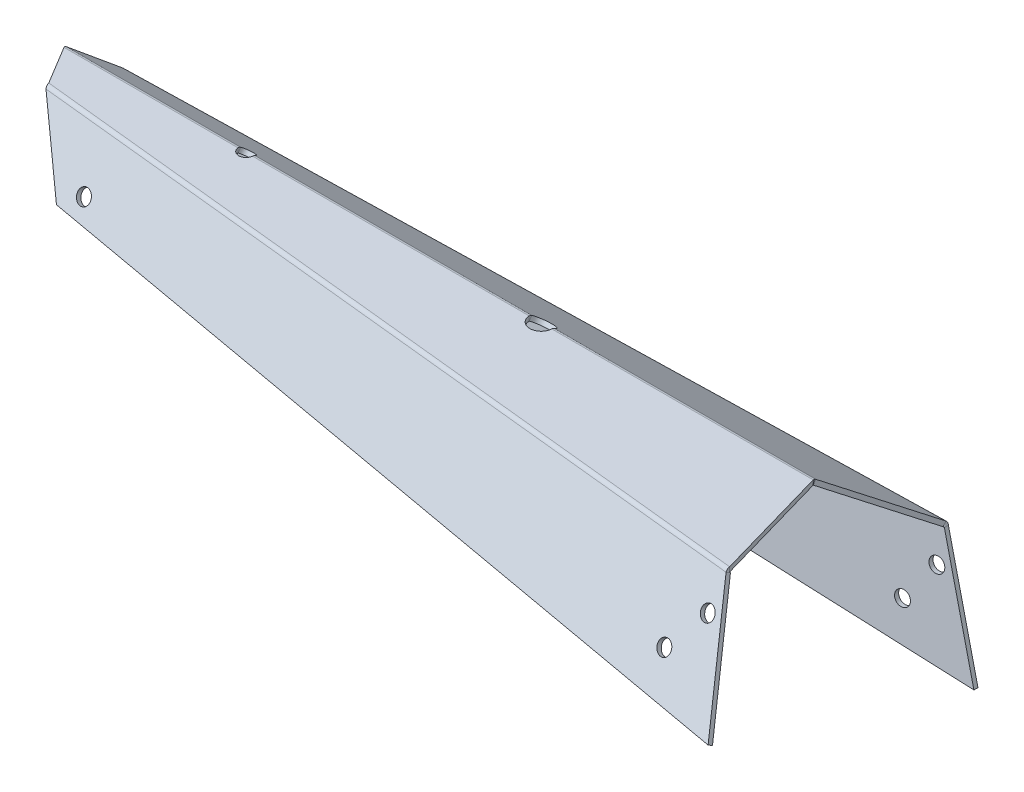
ISO-10303-21;
HEADER;
FILE_DESCRIPTION(('STEP AP214'),'2;1');
FILE_NAME('part.step','',(''),(''),'','','');
FILE_SCHEMA(('AUTOMOTIVE_DESIGN { 1 0 10303 214 1 1 1 1 }'));
ENDSEC;
DATA;
#1=APPLICATION_CONTEXT('core data for automotive mechanical design processes');
#2=APPLICATION_PROTOCOL_DEFINITION('international standard','automotive_design',2000,#1);
#3=PRODUCT_CONTEXT('',#1,'mechanical');
#4=PRODUCT('Part','Part','',(#3));
#5=PRODUCT_RELATED_PRODUCT_CATEGORY('part','',(#4));
#6=PRODUCT_DEFINITION_FORMATION('','',#4);
#7=PRODUCT_DEFINITION_CONTEXT('part definition',#1,'design');
#8=PRODUCT_DEFINITION('design','',#6,#7);
#9=PRODUCT_DEFINITION_SHAPE('','',#8);
#10=(LENGTH_UNIT() NAMED_UNIT(*) SI_UNIT(.MILLI.,.METRE.));
#11=(NAMED_UNIT(*) PLANE_ANGLE_UNIT() SI_UNIT($,.RADIAN.));
#12=(NAMED_UNIT(*) SI_UNIT($,.STERADIAN.) SOLID_ANGLE_UNIT());
#13=UNCERTAINTY_MEASURE_WITH_UNIT(LENGTH_MEASURE(1.E-05),#10,'distance_accuracy_value','');
#14=(GEOMETRIC_REPRESENTATION_CONTEXT(3) GLOBAL_UNCERTAINTY_ASSIGNED_CONTEXT((#13)) GLOBAL_UNIT_ASSIGNED_CONTEXT((#10,
#11,#12)) REPRESENTATION_CONTEXT('',''));
#15=CARTESIAN_POINT('',(0.,0.,0.));
#16=DIRECTION('',(0.,0.,1.));
#17=DIRECTION('',(1.,0.,0.));
#18=AXIS2_PLACEMENT_3D('',#15,#16,#17);
#19=CARTESIAN_POINT('',(107.110760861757,-29.2966398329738,-43.3522376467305));
#20=DIRECTION('',(-0.961741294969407,-0.157136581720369,-0.224414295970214));
#21=DIRECTION('',(-0.273959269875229,0.551632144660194,0.787812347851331));
#22=AXIS2_PLACEMENT_3D('',#19,#20,#21);
#23=PLANE('',#22);
#24=DIRECTION('',(0.273959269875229,-0.551632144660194,-0.787812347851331));
#25=VECTOR('',#24,1.);
#26=CARTESIAN_POINT('',(107.110760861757,-29.2966398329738,-43.3522376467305));
#27=LINE('',#26,#25);
#28=CARTESIAN_POINT('',(92.1551333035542,0.817343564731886,-0.345012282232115));
#29=VERTEX_POINT('',#28);
#30=CARTESIAN_POINT('',(99.5406255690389,-14.0537536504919,-21.583140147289));
#31=VERTEX_POINT('',#30);
#32=EDGE_CURVE('E639',#29,#31,#27,.T.);
#33=ORIENTED_EDGE('',*,*,#32,.F.);
#34=CARTESIAN_POINT('',(92.1551333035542,-0.00180847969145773,0.228564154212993));
#35=CARTESIAN_POINT('',(92.1551333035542,0.817343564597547,-0.345012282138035));
#36=B_SPLINE_CURVE_WITH_KNOTS('',1,(#34,#35),.UNSPECIFIED.,.F.,.F.,(2,2),(0.,1.),.UNSPECIFIED.);
#37=CARTESIAN_POINT('',(92.1551333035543,-0.00180847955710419,0.228564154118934));
#38=VERTEX_POINT('',#37);
#39=EDGE_CURVE('E641',#29,#38,#36,.F.);
#40=ORIENTED_EDGE('',*,*,#39,.T.);
#41=DIRECTION('',(0.273959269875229,-0.551632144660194,-0.787812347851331));
#42=VECTOR('',#41,1.);
#43=CARTESIAN_POINT('',(107.110760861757,-30.1157918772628,-42.7786612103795));
#44=LINE('',#43,#42);
#45=CARTESIAN_POINT('',(99.5406255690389,-14.8729056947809,-21.009563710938));
#46=VERTEX_POINT('',#45);
#47=EDGE_CURVE('E1537',#38,#46,#44,.T.);
#48=ORIENTED_EDGE('',*,*,#47,.T.);
#49=CARTESIAN_POINT('',(99.5406255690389,-14.0537536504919,-21.583140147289));
#50=CARTESIAN_POINT('',(99.5406255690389,-14.8729056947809,-21.009563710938));
#51=B_SPLINE_CURVE_WITH_KNOTS('',1,(#49,#50),.UNSPECIFIED.,.F.,.F.,(2,2),(0.,1.),.UNSPECIFIED.);
#52=EDGE_CURVE('E645',#46,#31,#51,.F.);
#53=ORIENTED_EDGE('',*,*,#52,.T.);
#54=EDGE_LOOP('',(#33,#40,#48,#53));
#55=FACE_BOUND('',#54,.T.);
#56=ADVANCED_FACE('F118',(#55),#23,.F.);
#57=CARTESIAN_POINT('',(-57.8483412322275,-13.4777635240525,-20.7605409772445));
#58=DIRECTION('',(0.857586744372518,0.295012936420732,0.421322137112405));
#59=DIRECTION('',(0.514339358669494,-0.491891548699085,-0.702493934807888));
#60=AXIS2_PLACEMENT_3D('',#57,#58,#59);
#61=PLANE('',#60);
#62=DIRECTION('',(-0.514339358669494,0.491891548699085,0.702493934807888));
#63=VECTOR('',#62,1.);
#64=CARTESIAN_POINT('',(-57.8483412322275,-14.2969155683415,-20.1869645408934));
#65=LINE('',#64,#63);
#66=CARTESIAN_POINT('',(-67.617082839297,-4.95452059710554,-6.84464178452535));
#67=VERTEX_POINT('',#66);
#68=CARTESIAN_POINT('',(-72.7958153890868,-0.00180847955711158,0.228564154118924));
#69=VERTEX_POINT('',#68);
#70=EDGE_CURVE('E143',#67,#69,#65,.T.);
#71=ORIENTED_EDGE('',*,*,#70,.T.);
#72=CARTESIAN_POINT('',(-72.7958153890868,0.817343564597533,-0.345012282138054));
#73=CARTESIAN_POINT('',(-72.7958153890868,-0.00180847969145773,0.228564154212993));
#74=B_SPLINE_CURVE_WITH_KNOTS('',1,(#72,#73),.UNSPECIFIED.,.F.,.F.,(2,2),(0.,1.),.UNSPECIFIED.);
#75=CARTESIAN_POINT('',(-72.7958153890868,0.817343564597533,-0.345012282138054));
#76=VERTEX_POINT('',#75);
#77=EDGE_CURVE('E1727',#69,#76,#74,.F.);
#78=ORIENTED_EDGE('',*,*,#77,.T.);
#79=DIRECTION('',(-0.514339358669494,0.491891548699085,0.702493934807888));
#80=VECTOR('',#79,1.);
#81=CARTESIAN_POINT('',(-57.8483412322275,-13.4777635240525,-20.7605409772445));
#82=LINE('',#81,#80);
#83=CARTESIAN_POINT('',(-67.617082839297,-4.135368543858,-7.41821822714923));
#84=VERTEX_POINT('',#83);
#85=EDGE_CURVE('E650',#84,#76,#82,.T.);
#86=ORIENTED_EDGE('',*,*,#85,.F.);
#87=CARTESIAN_POINT('',(-67.617082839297,-4.95452058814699,-6.84464179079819));
#88=CARTESIAN_POINT('',(-67.617082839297,-4.135368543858,-7.41821822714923));
#89=B_SPLINE_CURVE_WITH_KNOTS('',1,(#87,#88),.UNSPECIFIED.,.F.,.F.,(2,2),(0.,1.),.UNSPECIFIED.);
#90=EDGE_CURVE('E1507',#84,#67,#89,.F.);
#91=ORIENTED_EDGE('',*,*,#90,.T.);
#92=EDGE_LOOP('',(#71,#78,#86,#91));
#93=FACE_BOUND('',#92,.T.);
#94=ADVANCED_FACE('F629',(#93),#61,.F.);
#95=CARTESIAN_POINT('',(-85.2590756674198,-11.6683427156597,-16.4329734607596));
#96=DIRECTION('',(0.,0.819152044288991,-0.573576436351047));
#97=DIRECTION('',(0.,0.573576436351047,0.819152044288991));
#98=AXIS2_PLACEMENT_3D('',#95,#96,#97);
#99=PLANE('',#98);
#100=ORIENTED_EDGE('',*,*,#47,.F.);
#101=DIRECTION('',(-1.,0.,0.));
#102=VECTOR('',#101,1.);
#103=CARTESIAN_POINT('',(-85.2590756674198,-0.00180847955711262,0.228564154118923));
#104=LINE('',#103,#102);
#105=CARTESIAN_POINT('',(34.6059032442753,-0.00180847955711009,0.228564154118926));
#106=VERTEX_POINT('',#105);
#107=EDGE_CURVE('E664',#38,#106,#104,.T.);
#108=ORIENTED_EDGE('',*,*,#107,.T.);
#109=CARTESIAN_POINT('',(32.1107608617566,0.0875378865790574,0.356163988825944));
#110=DIRECTION('',(0.,0.819152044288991,-0.573576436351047));
#111=DIRECTION('',(0.,0.573576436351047,0.819152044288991));
#112=AXIS2_PLACEMENT_3D('',#109,#110,#111);
#113=CIRCLE('',#112,2.5);
#114=CARTESIAN_POINT('',(29.6156184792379,-0.00180847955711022,0.228564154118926));
#115=VERTEX_POINT('',#114);
#116=EDGE_CURVE('E1662',#106,#115,#113,.T.);
#117=ORIENTED_EDGE('',*,*,#116,.T.);
#118=DIRECTION('',(-1.,0.,0.));
#119=VECTOR('',#118,1.);
#120=CARTESIAN_POINT('',(-85.2590756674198,-0.00180847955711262,0.228564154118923));
#121=LINE('',#120,#119);
#122=CARTESIAN_POINT('',(-31.2968398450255,-0.00180847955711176,0.228564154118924));
#123=VERTEX_POINT('',#122);
#124=EDGE_CURVE('E317',#115,#123,#121,.T.);
#125=ORIENTED_EDGE('',*,*,#124,.T.);
#126=CARTESIAN_POINT('',(-32.8892391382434,0.0875378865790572,0.356163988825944));
#127=DIRECTION('',(0.,0.819152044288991,-0.573576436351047));
#128=DIRECTION('',(0.,0.573576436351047,0.819152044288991));
#129=AXIS2_PLACEMENT_3D('',#126,#127,#128);
#130=CIRCLE('',#129,1.6);
#131=CARTESIAN_POINT('',(-34.4816384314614,-0.00180847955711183,0.228564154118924));
#132=VERTEX_POINT('',#131);
#133=EDGE_CURVE('E135',#123,#132,#130,.T.);
#134=ORIENTED_EDGE('',*,*,#133,.T.);
#135=DIRECTION('',(-1.,0.,0.));
#136=VECTOR('',#135,1.);
#137=CARTESIAN_POINT('',(-85.2590756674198,-0.00180847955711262,0.228564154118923));
#138=LINE('',#137,#136);
#139=EDGE_CURVE('E127',#132,#69,#138,.T.);
#140=ORIENTED_EDGE('',*,*,#139,.T.);
#141=ORIENTED_EDGE('',*,*,#70,.F.);
#142=DIRECTION('',(0.994691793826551,-0.0590205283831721,-0.0842900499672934));
#143=VECTOR('',#142,1.);
#144=CARTESIAN_POINT('',(-83.8742173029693,-3.98989550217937,-5.46701437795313));
#145=LINE('',#144,#143);
#146=EDGE_CURVE('E1551',#67,#46,#145,.T.);
#147=ORIENTED_EDGE('',*,*,#146,.T.);
#148=EDGE_LOOP('',(#100,#108,#117,#125,#134,#140,#141,#147));
#149=FACE_BOUND('',#148,.T.);
#150=ADVANCED_FACE('F634',(#149),#99,.F.);
#151=CARTESIAN_POINT('',(-85.2590756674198,-10.8491906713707,-17.0065498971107));
#152=DIRECTION('',(0.,0.819152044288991,-0.573576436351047));
#153=DIRECTION('',(0.,0.573576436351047,0.819152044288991));
#154=AXIS2_PLACEMENT_3D('',#151,#152,#153);
#155=PLANE('',#154);
#156=DIRECTION('',(-1.,0.,0.));
#157=VECTOR('',#156,1.);
#158=CARTESIAN_POINT('',(-85.2590756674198,0.817343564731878,-0.345012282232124));
#159=LINE('',#158,#157);
#160=CARTESIAN_POINT('',(34.6059032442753,0.817343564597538,-0.345012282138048));
#161=VERTEX_POINT('',#160);
#162=EDGE_CURVE('E673',#29,#161,#159,.T.);
#163=ORIENTED_EDGE('',*,*,#162,.F.);
#164=ORIENTED_EDGE('',*,*,#32,.T.);
#165=DIRECTION('',(0.994691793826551,-0.0590205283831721,-0.0842900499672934));
#166=VECTOR('',#165,1.);
#167=CARTESIAN_POINT('',(-83.8742173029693,-3.17074345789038,-6.04059081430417));
#168=LINE('',#167,#166);
#169=EDGE_CURVE('E1554',#84,#31,#168,.T.);
#170=ORIENTED_EDGE('',*,*,#169,.F.);
#171=ORIENTED_EDGE('',*,*,#85,.T.);
#172=DIRECTION('',(-1.,0.,0.));
#173=VECTOR('',#172,1.);
#174=CARTESIAN_POINT('',(-85.2590756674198,0.817343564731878,-0.345012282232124));
#175=LINE('',#174,#173);
#176=CARTESIAN_POINT('',(-34.4816384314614,0.817343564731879,-0.345012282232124));
#177=VERTEX_POINT('',#176);
#178=EDGE_CURVE('E1530',#177,#76,#175,.T.);
#179=ORIENTED_EDGE('',*,*,#178,.F.);
#180=CARTESIAN_POINT('',(-32.8892391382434,0.906689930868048,-0.217412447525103));
#181=DIRECTION('',(0.,0.819152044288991,-0.573576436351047));
#182=DIRECTION('',(0.,0.573576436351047,0.819152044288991));
#183=AXIS2_PLACEMENT_3D('',#180,#181,#182);
#184=CIRCLE('',#183,1.6);
#185=CARTESIAN_POINT('',(-31.2968398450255,0.817343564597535,-0.345012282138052));
#186=VERTEX_POINT('',#185);
#187=EDGE_CURVE('E1533',#186,#177,#184,.T.);
#188=ORIENTED_EDGE('',*,*,#187,.F.);
#189=DIRECTION('',(-1.,0.,0.));
#190=VECTOR('',#189,1.);
#191=CARTESIAN_POINT('',(-85.2590756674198,0.817343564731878,-0.345012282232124));
#192=LINE('',#191,#190);
#193=CARTESIAN_POINT('',(29.6156184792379,0.817343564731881,-0.345012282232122));
#194=VERTEX_POINT('',#193);
#195=EDGE_CURVE('E663',#194,#186,#192,.T.);
#196=ORIENTED_EDGE('',*,*,#195,.F.);
#197=CARTESIAN_POINT('',(32.1107608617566,0.906689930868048,-0.217412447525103));
#198=DIRECTION('',(0.,0.819152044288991,-0.573576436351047));
#199=DIRECTION('',(0.,0.573576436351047,0.819152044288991));
#200=AXIS2_PLACEMENT_3D('',#197,#198,#199);
#201=CIRCLE('',#200,2.5);
#202=EDGE_CURVE('E1534',#161,#194,#201,.T.);
#203=ORIENTED_EDGE('',*,*,#202,.F.);
#204=EDGE_LOOP('',(#163,#164,#170,#171,#179,#188,#196,#203));
#205=FACE_BOUND('',#204,.T.);
#206=ADVANCED_FACE('F1278',(#205),#155,.T.);
#207=CARTESIAN_POINT('',(-32.8892391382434,0.906689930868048,-0.217412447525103));
#208=DIRECTION('',(0.,-0.819152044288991,0.573576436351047));
#209=DIRECTION('',(0.,-0.573576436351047,-0.819152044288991));
#210=AXIS2_PLACEMENT_3D('',#207,#208,#209);
#211=CYLINDRICAL_SURFACE('',#210,1.6);
#212=DIRECTION('',(0.,-0.819152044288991,0.573576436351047));
#213=VECTOR('',#212,1.);
#214=CARTESIAN_POINT('',(-31.2968398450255,0.817343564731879,-0.345012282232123));
#215=LINE('',#214,#213);
#216=EDGE_CURVE('E1525',#186,#123,#215,.T.);
#217=ORIENTED_EDGE('',*,*,#216,.F.);
#218=ORIENTED_EDGE('',*,*,#187,.T.);
#219=DIRECTION('',(0.,0.819152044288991,-0.573576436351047));
#220=VECTOR('',#219,1.);
#221=CARTESIAN_POINT('',(-34.4816384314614,0.817343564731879,-0.345012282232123));
#222=LINE('',#221,#220);
#223=EDGE_CURVE('E12',#132,#177,#222,.T.);
#224=ORIENTED_EDGE('',*,*,#223,.F.);
#225=ORIENTED_EDGE('',*,*,#133,.F.);
#226=EDGE_LOOP('',(#217,#218,#224,#225));
#227=FACE_BOUND('',#226,.T.);
#228=ADVANCED_FACE('F1405',(#227),#211,.F.);
#229=CARTESIAN_POINT('',(32.1107608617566,0.906689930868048,-0.217412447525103));
#230=DIRECTION('',(0.,-0.819152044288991,0.573576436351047));
#231=DIRECTION('',(0.,-0.573576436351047,-0.819152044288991));
#232=AXIS2_PLACEMENT_3D('',#229,#230,#231);
#233=CYLINDRICAL_SURFACE('',#232,2.5);
#234=DIRECTION('',(0.,-0.819152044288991,0.573576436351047));
#235=VECTOR('',#234,1.);
#236=CARTESIAN_POINT('',(34.6059032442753,0.817343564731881,-0.345012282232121));
#237=LINE('',#236,#235);
#238=EDGE_CURVE('E1506',#161,#106,#237,.T.);
#239=ORIENTED_EDGE('',*,*,#238,.F.);
#240=ORIENTED_EDGE('',*,*,#202,.T.);
#241=DIRECTION('',(0.,0.819152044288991,-0.573576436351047));
#242=VECTOR('',#241,1.);
#243=CARTESIAN_POINT('',(29.6156184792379,0.817343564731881,-0.345012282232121));
#244=LINE('',#243,#242);
#245=EDGE_CURVE('E1529',#115,#194,#244,.T.);
#246=ORIENTED_EDGE('',*,*,#245,.F.);
#247=ORIENTED_EDGE('',*,*,#116,.F.);
#248=EDGE_LOOP('',(#239,#240,#246,#247));
#249=FACE_BOUND('',#248,.T.);
#250=ADVANCED_FACE('F1396',(#249),#233,.F.);
#251=CARTESIAN_POINT('',(-67.2972946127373,-5.10750459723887,-7.87237479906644));
#252=CARTESIAN_POINT('',(-67.3571206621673,-4.92279451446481,-7.88914263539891));
#253=CARTESIAN_POINT('',(-67.4123085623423,-4.73253479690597,-7.85598478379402));
#254=CARTESIAN_POINT('',(-67.5173596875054,-4.39253341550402,-7.6975401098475));
#255=CARTESIAN_POINT('',(-67.5672063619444,-4.24342411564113,-7.57253757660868));
#256=CARTESIAN_POINT('',(-67.617082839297,-4.135368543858,-7.41821822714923));
#257=CARTESIAN_POINT('',(-67.2064400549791,-4.98832353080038,-6.8836679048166));
#258=CARTESIAN_POINT('',(-67.274944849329,-4.98246610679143,-6.87807890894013));
#259=CARTESIAN_POINT('',(-67.3434043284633,-4.97655168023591,-6.87199579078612));
#260=CARTESIAN_POINT('',(-67.4802699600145,-4.96512605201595,-6.85891719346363));
#261=CARTESIAN_POINT('',(-67.5486765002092,-4.95961948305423,-6.85192376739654));
#262=CARTESIAN_POINT('',(-67.617082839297,-4.95452058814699,-6.84464179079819));
#263=B_SPLINE_SURFACE_WITH_KNOTS('',1,3,((#251,#252,#253,#254,#255,#256),(#257,#258,#259,#260,
#261,#262)),.UNSPECIFIED.,.F.,.F.,.F.,(2,2),(4,2,4),(0.,1.),(0.,0.5,1.),.UNSPECIFIED.);
#264=CARTESIAN_POINT('',(-67.2972946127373,-5.10750459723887,-7.87237479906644));
#265=CARTESIAN_POINT('',(-67.2064400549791,-4.98832353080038,-6.8836679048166));
#266=B_SPLINE_CURVE_WITH_KNOTS('',1,(#264,#265),.UNSPECIFIED.,.F.,.F.,(2,2),(0.,1.),.UNSPECIFIED.);
#267=CARTESIAN_POINT('',(-67.2972946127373,-5.10750459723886,-7.87237479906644));
#268=VERTEX_POINT('',#267);
#269=CARTESIAN_POINT('',(-67.2064400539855,-4.98832352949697,-6.88366789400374));
#270=VERTEX_POINT('',#269);
#271=EDGE_CURVE('E405',#268,#270,#266,.T.);
#272=CARTESIAN_POINT('',(-67.2064400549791,-4.98832353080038,-6.8836679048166));
#273=CARTESIAN_POINT('',(-67.274944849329,-4.98246610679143,-6.87807890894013));
#274=CARTESIAN_POINT('',(-67.3434043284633,-4.97655168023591,-6.87199579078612));
#275=CARTESIAN_POINT('',(-67.4802699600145,-4.96512605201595,-6.85891719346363));
#276=CARTESIAN_POINT('',(-67.5486765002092,-4.95961948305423,-6.85192376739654));
#277=CARTESIAN_POINT('',(-67.617082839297,-4.95452058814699,-6.84464179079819));
#278=B_SPLINE_CURVE_WITH_KNOTS('',3,(#272,#273,#274,#275,#276,#277),.UNSPECIFIED.,.F.,.F.,(4,2,
4),(0.,0.5,1.),.UNSPECIFIED.);
#279=EDGE_CURVE('E1620',#270,#67,#278,.T.);
#280=CARTESIAN_POINT('',(-67.617082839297,-4.135368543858,-7.41821822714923));
#281=CARTESIAN_POINT('',(-67.5672063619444,-4.24342411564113,-7.57253757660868));
#282=CARTESIAN_POINT('',(-67.5173596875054,-4.39253341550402,-7.6975401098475));
#283=CARTESIAN_POINT('',(-67.4123085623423,-4.73253479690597,-7.85598478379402));
#284=CARTESIAN_POINT('',(-67.3571206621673,-4.92279451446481,-7.88914263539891));
#285=CARTESIAN_POINT('',(-67.2972946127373,-5.10750459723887,-7.87237479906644));
#286=B_SPLINE_CURVE_WITH_KNOTS('',3,(#280,#281,#282,#283,#284,#285),.UNSPECIFIED.,.F.,.F.,(4,2,
4),(0.,0.5,1.),.UNSPECIFIED.);
#287=EDGE_CURVE('E1622',#268,#84,#286,.F.);
#288=ORIENTED_EDGE('',*,*,#271,.T.);
#289=ORIENTED_EDGE('',*,*,#279,.T.);
#290=ORIENTED_EDGE('',*,*,#90,.F.);
#291=ORIENTED_EDGE('',*,*,#287,.F.);
#292=EDGE_LOOP('',(#288,#289,#290,#291));
#293=FACE_BOUND('',#292,.T.);
#294=ADVANCED_FACE('F1380',(#293),#263,.T.);
#295=CARTESIAN_POINT('',(99.5406255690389,-14.0537536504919,-21.583140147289));
#296=CARTESIAN_POINT('',(99.5584981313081,-14.1599160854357,-21.7347558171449));
#297=CARTESIAN_POINT('',(99.5763749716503,-14.3071226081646,-21.8570409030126));
#298=CARTESIAN_POINT('',(99.6174523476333,-14.6433280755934,-22.0100644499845));
#299=CARTESIAN_POINT('',(99.64066986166,-14.8316807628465,-22.0405143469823));
#300=CARTESIAN_POINT('',(99.6684925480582,-15.014501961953,-22.0210333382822));
#301=CARTESIAN_POINT('',(99.5406255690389,-14.8729056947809,-21.009563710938));
#302=CARTESIAN_POINT('',(99.5770450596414,-14.8761066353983,-21.0141351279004));
#303=CARTESIAN_POINT('',(99.6134646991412,-14.8797152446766,-21.0184179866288));
#304=CARTESIAN_POINT('',(99.6863565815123,-14.8873449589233,-21.0260754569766));
#305=CARTESIAN_POINT('',(99.722829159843,-14.8913614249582,-21.0294480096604));
#306=CARTESIAN_POINT('',(99.7593471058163,-14.8953208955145,-21.0323264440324));
#307=B_SPLINE_SURFACE_WITH_KNOTS('',1,3,((#295,#296,#297,#298,#299,#300),(#301,#302,#303,#304,
#305,#306)),.UNSPECIFIED.,.F.,.F.,.F.,(2,2),(4,2,4),(0.,1.),(0.,0.5,1.),.UNSPECIFIED.);
#308=CARTESIAN_POINT('',(99.5406255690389,-14.8729056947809,-21.009563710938));
#309=CARTESIAN_POINT('',(99.5770450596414,-14.8761066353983,-21.0141351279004));
#310=CARTESIAN_POINT('',(99.6134646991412,-14.8797152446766,-21.0184179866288));
#311=CARTESIAN_POINT('',(99.6863565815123,-14.8873449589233,-21.0260754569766));
#312=CARTESIAN_POINT('',(99.722829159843,-14.8913614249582,-21.0294480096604));
#313=CARTESIAN_POINT('',(99.7593471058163,-14.8953208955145,-21.0323264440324));
#314=B_SPLINE_CURVE_WITH_KNOTS('',3,(#308,#309,#310,#311,#312,#313),.UNSPECIFIED.,.F.,.F.,(4,2,
4),(0.,0.5,1.),.UNSPECIFIED.);
#315=CARTESIAN_POINT('',(99.7593471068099,-14.8953208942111,-21.0323264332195));
#316=VERTEX_POINT('',#315);
#317=EDGE_CURVE('E1632',#46,#316,#314,.T.);
#318=CARTESIAN_POINT('',(99.7593471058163,-14.8953208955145,-21.0323264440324));
#319=CARTESIAN_POINT('',(99.6684925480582,-15.014501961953,-22.0210333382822));
#320=B_SPLINE_CURVE_WITH_KNOTS('',1,(#318,#319),.UNSPECIFIED.,.F.,.F.,(2,2),(0.,1.),.UNSPECIFIED.);
#321=CARTESIAN_POINT('',(99.6684925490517,-15.0145019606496,-22.0210333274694));
#322=VERTEX_POINT('',#321);
#323=EDGE_CURVE('E1600',#316,#322,#320,.T.);
#324=CARTESIAN_POINT('',(99.6684925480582,-15.014501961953,-22.0210333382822));
#325=CARTESIAN_POINT('',(99.64066986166,-14.8316807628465,-22.0405143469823));
#326=CARTESIAN_POINT('',(99.6174523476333,-14.6433280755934,-22.0100644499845));
#327=CARTESIAN_POINT('',(99.5763749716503,-14.3071226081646,-21.8570409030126));
#328=CARTESIAN_POINT('',(99.5584981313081,-14.1599160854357,-21.7347558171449));
#329=CARTESIAN_POINT('',(99.5406255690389,-14.0537536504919,-21.583140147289));
#330=B_SPLINE_CURVE_WITH_KNOTS('',3,(#324,#325,#326,#327,#328,#329),.UNSPECIFIED.,.F.,.F.,(4,2,
4),(0.,0.5,1.),.UNSPECIFIED.);
#331=EDGE_CURVE('E1659',#31,#322,#330,.F.);
#332=ORIENTED_EDGE('',*,*,#317,.T.);
#333=ORIENTED_EDGE('',*,*,#323,.T.);
#334=ORIENTED_EDGE('',*,*,#331,.F.);
#335=ORIENTED_EDGE('',*,*,#52,.F.);
#336=EDGE_LOOP('',(#332,#333,#334,#335));
#337=FACE_BOUND('',#336,.T.);
#338=ADVANCED_FACE('F1370',(#337),#307,.T.);
#339=CARTESIAN_POINT('',(183.342965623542,-19.8535504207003,-28.1052270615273));
#340=DIRECTION('',(-0.994691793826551,0.0590205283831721,0.0842900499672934));
#341=DIRECTION('',(0.102899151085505,0.570531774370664,0.814803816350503));
#342=AXIS2_PLACEMENT_3D('',#339,#340,#341);
#343=CYLINDRICAL_SURFACE('',#342,1.01000001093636);
#344=ORIENTED_EDGE('',*,*,#169,.T.);
#345=ORIENTED_EDGE('',*,*,#331,.T.);
#346=DIRECTION('',(0.994691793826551,-0.0590205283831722,-0.0842900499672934));
#347=VECTOR('',#346,1.);
#348=CARTESIAN_POINT('',(-83.9659804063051,-4.11845989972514,-6.45987257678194));
#349=LINE('',#348,#347);
#350=EDGE_CURVE('E1665',#268,#322,#349,.T.);
#351=ORIENTED_EDGE('',*,*,#350,.F.);
#352=ORIENTED_EDGE('',*,*,#287,.T.);
#353=EDGE_LOOP('',(#344,#345,#351,#352));
#354=FACE_BOUND('',#353,.T.);
#355=ADVANCED_FACE('F1367',(#354),#343,.T.);
#356=CARTESIAN_POINT('',(183.342965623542,-19.8535504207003,-28.1052270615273));
#357=DIRECTION('',(-0.994691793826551,0.0590205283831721,0.0842900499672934));
#358=DIRECTION('',(0.102899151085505,0.570531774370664,0.814803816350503));
#359=AXIS2_PLACEMENT_3D('',#356,#357,#358);
#360=CYLINDRICAL_SURFACE('',#359,0.0100000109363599);
#361=ORIENTED_EDGE('',*,*,#146,.F.);
#362=ORIENTED_EDGE('',*,*,#279,.F.);
#363=DIRECTION('',(0.994691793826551,-0.0590205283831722,-0.0842900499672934));
#364=VECTOR('',#363,1.);
#365=CARTESIAN_POINT('',(-83.8751258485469,-3.99927883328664,-5.4711656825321));
#366=LINE('',#365,#364);
#367=EDGE_CURVE('E1627',#270,#316,#366,.T.);
#368=ORIENTED_EDGE('',*,*,#367,.T.);
#369=ORIENTED_EDGE('',*,*,#317,.F.);
#370=EDGE_LOOP('',(#361,#362,#368,#369));
#371=FACE_BOUND('',#370,.T.);
#372=ADVANCED_FACE('F1357',(#371),#360,.F.);
#373=CARTESIAN_POINT('',(-57.0838635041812,-20.2698506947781,-6.98320549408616));
#374=DIRECTION('',(0.110416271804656,0.985486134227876,-0.128939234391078));
#375=DIRECTION('',(0.989724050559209,-0.120884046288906,-0.0763763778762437));
#376=AXIS2_PLACEMENT_3D('',#373,#374,#375);
#377=PLANE('',#376);
#378=DIRECTION('',(-0.989724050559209,0.120884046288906,0.0763763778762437));
#379=VECTOR('',#378,1.);
#380=CARTESIAN_POINT('',(-56.9930089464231,-20.1506696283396,-5.99449859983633));
#381=LINE('',#380,#379);
#382=CARTESIAN_POINT('',(108.537049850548,-40.3683689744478,-18.7683483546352));
#383=VERTEX_POINT('',#382);
#384=CARTESIAN_POINT('',(-56.9930089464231,-20.1506696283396,-5.99449859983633));
#385=VERTEX_POINT('',#384);
#386=EDGE_CURVE('E1826',#383,#385,#381,.T.);
#387=ORIENTED_EDGE('',*,*,#386,.T.);
#388=DIRECTION('',(0.0908545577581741,0.119181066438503,0.988706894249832));
#389=VECTOR('',#388,1.);
#390=CARTESIAN_POINT('',(-57.0838635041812,-20.2698506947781,-6.98320549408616));
#391=LINE('',#390,#389);
#392=CARTESIAN_POINT('',(-57.0838635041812,-20.2698506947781,-6.98320549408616));
#393=VERTEX_POINT('',#392);
#394=EDGE_CURVE('E1711',#393,#385,#391,.T.);
#395=ORIENTED_EDGE('',*,*,#394,.F.);
#396=DIRECTION('',(-0.989724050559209,0.120884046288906,0.0763763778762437));
#397=VECTOR('',#396,1.);
#398=CARTESIAN_POINT('',(-57.0838635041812,-20.2698506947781,-6.98320549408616));
#399=LINE('',#398,#397);
#400=CARTESIAN_POINT('',(108.44619529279,-40.4875500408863,-19.757055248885));
#401=VERTEX_POINT('',#400);
#402=EDGE_CURVE('E1688',#401,#393,#399,.T.);
#403=ORIENTED_EDGE('',*,*,#402,.F.);
#404=DIRECTION('',(0.0908545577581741,0.119181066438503,0.988706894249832));
#405=VECTOR('',#404,1.);
#406=CARTESIAN_POINT('',(108.44619529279,-40.4875500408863,-19.757055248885));
#407=LINE('',#406,#405);
#408=EDGE_CURVE('E1823',#401,#383,#407,.T.);
#409=ORIENTED_EDGE('',*,*,#408,.T.);
#410=EDGE_LOOP('',(#387,#395,#403,#409));
#411=FACE_BOUND('',#410,.T.);
#412=ADVANCED_FACE('F1347',(#411),#377,.F.);
#413=CARTESIAN_POINT('',(-52.2867768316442,-16.8598736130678,-7.83506755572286));
#414=DIRECTION('',(0.0908545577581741,0.119181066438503,0.988706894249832));
#415=DIRECTION('',(0.0543011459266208,-0.991928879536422,0.114579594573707));
#416=AXIS2_PLACEMENT_3D('',#413,#414,#415);
#417=CYLINDRICAL_SURFACE('',#416,1.6);
#418=CARTESIAN_POINT('',(-52.2867768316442,-16.8598736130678,-7.83506755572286));
#419=DIRECTION('',(-0.0908545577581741,-0.119181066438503,-0.988706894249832));
#420=DIRECTION('',(-0.0543011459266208,0.991928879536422,-0.114579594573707));
#421=AXIS2_PLACEMENT_3D('',#418,#419,#420);
#422=CIRCLE('',#421,1.6);
#423=CARTESIAN_POINT('',(-52.3736586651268,-15.2727874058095,-8.01839490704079));
#424=VERTEX_POINT('',#423);
#425=EDGE_CURVE('E1820',#424,#424,#422,.T.);
#426=ORIENTED_EDGE('',*,*,#425,.T.);
#427=EDGE_LOOP('',(#426));
#428=FACE_BOUND('',#427,.T.);
#429=CARTESIAN_POINT('',(-52.195922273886,-16.7406925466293,-6.84636066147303));
#430=DIRECTION('',(-0.0908545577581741,-0.119181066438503,-0.988706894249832));
#431=DIRECTION('',(-0.0543011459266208,0.991928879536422,-0.114579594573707));
#432=AXIS2_PLACEMENT_3D('',#429,#430,#431);
#433=CIRCLE('',#432,1.6);
#434=CARTESIAN_POINT('',(-52.2828041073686,-15.153606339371,-7.02968801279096));
#435=VERTEX_POINT('',#434);
#436=EDGE_CURVE('E1806',#435,#435,#433,.T.);
#437=ORIENTED_EDGE('',*,*,#436,.F.);
#438=EDGE_LOOP('',(#437));
#439=FACE_BOUND('',#438,.T.);
#440=ADVANCED_FACE('F1337',(#428,#439),#417,.F.);
#441=CARTESIAN_POINT('',(92.9538385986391,-30.6035486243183,-19.5248677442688));
#442=DIRECTION('',(0.0908545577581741,0.119181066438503,0.988706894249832));
#443=DIRECTION('',(0.0543011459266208,-0.991928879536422,0.114579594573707));
#444=AXIS2_PLACEMENT_3D('',#441,#442,#443);
#445=CYLINDRICAL_SURFACE('',#444,1.60000000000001);
#446=CARTESIAN_POINT('',(92.9538385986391,-30.6035486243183,-19.5248677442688));
#447=DIRECTION('',(-0.0908545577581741,-0.119181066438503,-0.988706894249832));
#448=DIRECTION('',(-0.0543011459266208,0.991928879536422,-0.114579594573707));
#449=AXIS2_PLACEMENT_3D('',#446,#447,#448);
#450=CIRCLE('',#449,1.60000000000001);
#451=CARTESIAN_POINT('',(92.8669567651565,-29.01646241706,-19.7081950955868));
#452=VERTEX_POINT('',#451);
#453=EDGE_CURVE('E1817',#452,#452,#450,.T.);
#454=ORIENTED_EDGE('',*,*,#453,.T.);
#455=EDGE_LOOP('',(#454));
#456=FACE_BOUND('',#455,.T.);
#457=CARTESIAN_POINT('',(93.0446931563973,-30.4843675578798,-18.536160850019));
#458=DIRECTION('',(-0.0908545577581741,-0.119181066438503,-0.988706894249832));
#459=DIRECTION('',(-0.0543011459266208,0.991928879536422,-0.114579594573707));
#460=AXIS2_PLACEMENT_3D('',#457,#458,#459);
#461=CIRCLE('',#460,1.60000000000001);
#462=CARTESIAN_POINT('',(92.9578113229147,-28.8972813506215,-18.7194882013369));
#463=VERTEX_POINT('',#462);
#464=EDGE_CURVE('E1809',#463,#463,#461,.T.);
#465=ORIENTED_EDGE('',*,*,#464,.F.);
#466=EDGE_LOOP('',(#465));
#467=FACE_BOUND('',#466,.T.);
#468=ADVANCED_FACE('F1327',(#456,#467),#445,.F.);
#469=CARTESIAN_POINT('',(98.9395295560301,-22.0355718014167,-21.1077108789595));
#470=DIRECTION('',(0.0908545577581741,0.119181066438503,0.988706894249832));
#471=DIRECTION('',(0.0543011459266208,-0.991928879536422,0.114579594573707));
#472=AXIS2_PLACEMENT_3D('',#469,#470,#471);
#473=CYLINDRICAL_SURFACE('',#472,1.60000000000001);
#474=CARTESIAN_POINT('',(98.9395295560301,-22.0355718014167,-21.1077108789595));
#475=DIRECTION('',(-0.0908545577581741,-0.119181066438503,-0.988706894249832));
#476=DIRECTION('',(-0.0543011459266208,0.991928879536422,-0.114579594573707));
#477=AXIS2_PLACEMENT_3D('',#474,#475,#476);
#478=CIRCLE('',#477,1.60000000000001);
#479=CARTESIAN_POINT('',(98.8526477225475,-20.4484855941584,-21.2910382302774));
#480=VERTEX_POINT('',#479);
#481=EDGE_CURVE('E1680',#480,#480,#478,.T.);
#482=ORIENTED_EDGE('',*,*,#481,.T.);
#483=EDGE_LOOP('',(#482));
#484=FACE_BOUND('',#483,.T.);
#485=CARTESIAN_POINT('',(99.0303841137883,-21.9163907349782,-20.1190039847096));
#486=DIRECTION('',(-0.0908545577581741,-0.119181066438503,-0.988706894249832));
#487=DIRECTION('',(-0.0543011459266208,0.991928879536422,-0.114579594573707));
#488=AXIS2_PLACEMENT_3D('',#485,#486,#487);
#489=CIRCLE('',#488,1.60000000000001);
#490=CARTESIAN_POINT('',(98.9435022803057,-20.3293045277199,-20.3023313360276));
#491=VERTEX_POINT('',#490);
#492=EDGE_CURVE('E1707',#491,#491,#489,.T.);
#493=ORIENTED_EDGE('',*,*,#492,.F.);
#494=EDGE_LOOP('',(#493));
#495=FACE_BOUND('',#494,.T.);
#496=ADVANCED_FACE('F1317',(#484,#495),#473,.F.);
#497=CARTESIAN_POINT('',(-84.5894720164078,-16.9103392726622,-4.86061511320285));
#498=DIRECTION('',(-0.0908545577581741,-0.119181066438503,-0.988706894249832));
#499=DIRECTION('',(-0.0543011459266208,0.991928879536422,-0.114579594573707));
#500=AXIS2_PLACEMENT_3D('',#497,#498,#499);
#501=PLANE('',#500);
#502=ORIENTED_EDGE('',*,*,#481,.F.);
#503=EDGE_LOOP('',(#502));
#504=FACE_BOUND('',#503,.T.);
#505=ORIENTED_EDGE('',*,*,#453,.F.);
#506=EDGE_LOOP('',(#505));
#507=FACE_BOUND('',#506,.T.);
#508=ORIENTED_EDGE('',*,*,#425,.F.);
#509=EDGE_LOOP('',(#508));
#510=FACE_BOUND('',#509,.T.);
#511=DIRECTION('',(-0.558018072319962,0.828405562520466,-0.048580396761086));
#512=VECTOR('',#511,1.);
#513=CARTESIAN_POINT('',(-57.0838635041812,-20.2698506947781,-6.98320549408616));
#514=LINE('',#513,#512);
#515=EDGE_CURVE('E1673',#393,#268,#514,.T.);
#516=ORIENTED_EDGE('',*,*,#515,.T.);
#517=ORIENTED_EDGE('',*,*,#350,.T.);
#518=DIRECTION('',(0.324643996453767,-0.942122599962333,0.0837333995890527));
#519=VECTOR('',#518,1.);
#520=CARTESIAN_POINT('',(108.44619529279,-40.4875500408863,-19.757055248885));
#521=LINE('',#520,#519);
#522=EDGE_CURVE('E1684',#322,#401,#521,.T.);
#523=ORIENTED_EDGE('',*,*,#522,.T.);
#524=ORIENTED_EDGE('',*,*,#402,.T.);
#525=EDGE_LOOP('',(#516,#517,#523,#524));
#526=FACE_BOUND('',#525,.T.);
#527=ADVANCED_FACE('F1307',(#504,#507,#510,#526),#501,.T.);
#528=CARTESIAN_POINT('',(108.44619529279,-40.4875500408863,-19.757055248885));
#529=DIRECTION('',(-0.94146254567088,-0.313370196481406,0.124287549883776));
#530=DIRECTION('',(-0.324643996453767,0.942122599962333,-0.0837333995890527));
#531=AXIS2_PLACEMENT_3D('',#528,#529,#530);
#532=PLANE('',#531);
#533=ORIENTED_EDGE('',*,*,#323,.F.);
#534=DIRECTION('',(0.324643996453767,-0.942122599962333,0.0837333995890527));
#535=VECTOR('',#534,1.);
#536=CARTESIAN_POINT('',(108.537049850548,-40.3683689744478,-18.7683483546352));
#537=LINE('',#536,#535);
#538=EDGE_CURVE('E1705',#316,#383,#537,.T.);
#539=ORIENTED_EDGE('',*,*,#538,.T.);
#540=ORIENTED_EDGE('',*,*,#408,.F.);
#541=ORIENTED_EDGE('',*,*,#522,.F.);
#542=EDGE_LOOP('',(#533,#539,#540,#541));
#543=FACE_BOUND('',#542,.T.);
#544=ADVANCED_FACE('F1297',(#543),#532,.F.);
#545=CARTESIAN_POINT('',(-84.4986174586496,-16.7911582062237,-3.87190821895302));
#546=DIRECTION('',(-0.0908545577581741,-0.119181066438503,-0.988706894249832));
#547=DIRECTION('',(-0.0543011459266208,0.991928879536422,-0.114579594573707));
#548=AXIS2_PLACEMENT_3D('',#545,#546,#547);
#549=PLANE('',#548);
#550=ORIENTED_EDGE('',*,*,#367,.F.);
#551=DIRECTION('',(-0.558018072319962,0.828405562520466,-0.048580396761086));
#552=VECTOR('',#551,1.);
#553=CARTESIAN_POINT('',(-56.9930089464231,-20.1506696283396,-5.99449859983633));
#554=LINE('',#553,#552);
#555=EDGE_CURVE('E1633',#385,#270,#554,.T.);
#556=ORIENTED_EDGE('',*,*,#555,.F.);
#557=ORIENTED_EDGE('',*,*,#386,.F.);
#558=ORIENTED_EDGE('',*,*,#538,.F.);
#559=EDGE_LOOP('',(#550,#556,#557,#558));
#560=FACE_BOUND('',#559,.T.);
#561=ORIENTED_EDGE('',*,*,#492,.T.);
#562=EDGE_LOOP('',(#561));
#563=FACE_BOUND('',#562,.T.);
#564=ORIENTED_EDGE('',*,*,#464,.T.);
#565=EDGE_LOOP('',(#564));
#566=FACE_BOUND('',#565,.T.);
#567=ORIENTED_EDGE('',*,*,#436,.T.);
#568=EDGE_LOOP('',(#567));
#569=FACE_BOUND('',#568,.T.);
#570=ADVANCED_FACE('F1286',(#560,#563,#566,#569),#549,.F.);
#571=CARTESIAN_POINT('',(-57.0838635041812,-20.2698506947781,-6.98320549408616));
#572=DIRECTION('',(0.824840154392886,0.547302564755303,-0.141769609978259));
#573=DIRECTION('',(0.558018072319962,-0.828405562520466,0.0485803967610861));
#574=AXIS2_PLACEMENT_3D('',#571,#572,#573);
#575=PLANE('',#574);
#576=ORIENTED_EDGE('',*,*,#271,.F.);
#577=ORIENTED_EDGE('',*,*,#515,.F.);
#578=ORIENTED_EDGE('',*,*,#394,.T.);
#579=ORIENTED_EDGE('',*,*,#555,.T.);
#580=EDGE_LOOP('',(#576,#577,#578,#579));
#581=FACE_BOUND('',#580,.T.);
#582=ADVANCED_FACE('F1259',(#581),#575,.F.);
#583=CARTESIAN_POINT('',(-57.0838635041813,-12.4661070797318,17.6100486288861));
#584=DIRECTION('',(0.110416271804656,0.881219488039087,-0.459630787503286));
#585=DIRECTION('',(-0.989724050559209,0.0552147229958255,-0.131900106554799));
#586=AXIS2_PLACEMENT_3D('',#583,#584,#585);
#587=PLANE('',#586);
#588=DIRECTION('',(0.989724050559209,-0.0552147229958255,0.131900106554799));
#589=VECTOR('',#588,1.);
#590=CARTESIAN_POINT('',(-56.9930089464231,-12.9355786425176,16.7317879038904));
#591=LINE('',#590,#589);
#592=CARTESIAN_POINT('',(-56.9930089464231,-12.9355786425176,16.7317879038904));
#593=VERTEX_POINT('',#592);
#594=CARTESIAN_POINT('',(108.537049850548,-22.1701691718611,38.7919089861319));
#595=VERTEX_POINT('',#594);
#596=EDGE_CURVE('E341',#593,#595,#591,.T.);
#597=ORIENTED_EDGE('',*,*,#596,.T.);
#598=DIRECTION('',(0.0908545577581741,-0.469471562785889,-0.878260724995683));
#599=VECTOR('',#598,1.);
#600=CARTESIAN_POINT('',(108.44619529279,-21.7006976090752,39.6701697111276));
#601=LINE('',#600,#599);
#602=CARTESIAN_POINT('',(108.44619529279,-21.7006976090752,39.6701697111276));
#603=VERTEX_POINT('',#602);
#604=EDGE_CURVE('E478',#603,#595,#601,.T.);
#605=ORIENTED_EDGE('',*,*,#604,.F.);
#606=DIRECTION('',(0.989724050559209,-0.0552147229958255,0.131900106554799));
#607=VECTOR('',#606,1.);
#608=CARTESIAN_POINT('',(-57.0838635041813,-12.4661070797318,17.6100486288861));
#609=LINE('',#608,#607);
#610=CARTESIAN_POINT('',(-57.0838635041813,-12.4661070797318,17.6100486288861));
#611=VERTEX_POINT('',#610);
#612=EDGE_CURVE('E451',#611,#603,#609,.T.);
#613=ORIENTED_EDGE('',*,*,#612,.F.);
#614=DIRECTION('',(0.0908545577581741,-0.469471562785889,-0.878260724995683));
#615=VECTOR('',#614,1.);
#616=CARTESIAN_POINT('',(-57.0838635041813,-12.4661070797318,17.6100486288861));
#617=LINE('',#616,#615);
#618=EDGE_CURVE('E495',#611,#593,#617,.T.);
#619=ORIENTED_EDGE('',*,*,#618,.T.);
#620=EDGE_LOOP('',(#597,#605,#613,#619));
#621=FACE_BOUND('',#620,.T.);
#622=ADVANCED_FACE('F1249',(#621),#587,.F.);
#623=CARTESIAN_POINT('',(98.9795382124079,-5.9555660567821,30.2743488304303));
#624=DIRECTION('',(0.0908545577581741,-0.469471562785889,-0.878260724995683));
#625=DIRECTION('',(-0.0543011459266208,0.878260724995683,-0.475088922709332));
#626=AXIS2_PLACEMENT_3D('',#623,#624,#625);
#627=CYLINDRICAL_SURFACE('',#626,1.60000000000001);
#628=CARTESIAN_POINT('',(98.9795382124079,-5.9555660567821,30.2743488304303));
#629=DIRECTION('',(-0.0908545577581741,0.469471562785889,0.878260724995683));
#630=DIRECTION('',(0.0543011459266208,-0.878260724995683,0.475088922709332));
#631=AXIS2_PLACEMENT_3D('',#628,#629,#630);
#632=CIRCLE('',#631,1.60000000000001);
#633=CARTESIAN_POINT('',(99.0664200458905,-7.3607832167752,31.0344911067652));
#634=VERTEX_POINT('',#633);
#635=EDGE_CURVE('E493',#634,#634,#632,.T.);
#636=ORIENTED_EDGE('',*,*,#635,.T.);
#637=EDGE_LOOP('',(#636));
#638=FACE_BOUND('',#637,.T.);
#639=CARTESIAN_POINT('',(99.0703927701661,-6.42503761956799,29.3960881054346));
#640=DIRECTION('',(-0.0908545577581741,0.469471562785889,0.878260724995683));
#641=DIRECTION('',(0.0543011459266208,-0.878260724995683,0.475088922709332));
#642=AXIS2_PLACEMENT_3D('',#639,#640,#641);
#643=CIRCLE('',#642,1.60000000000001);
#644=CARTESIAN_POINT('',(99.1572746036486,-7.83025477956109,30.1562303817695));
#645=VERTEX_POINT('',#644);
#646=EDGE_CURVE('E473',#645,#645,#643,.T.);
#647=ORIENTED_EDGE('',*,*,#646,.F.);
#648=EDGE_LOOP('',(#647));
#649=FACE_BOUND('',#648,.T.);
#650=ADVANCED_FACE('F1240',(#638,#649),#627,.F.);
#651=CARTESIAN_POINT('',(92.9538385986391,-13.7373749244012,33.8107425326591));
#652=DIRECTION('',(0.0908545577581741,-0.469471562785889,-0.878260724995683));
#653=DIRECTION('',(-0.0543011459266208,0.878260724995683,-0.475088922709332));
#654=AXIS2_PLACEMENT_3D('',#651,#652,#653);
#655=CYLINDRICAL_SURFACE('',#654,1.60000000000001);
#656=CARTESIAN_POINT('',(92.9538385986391,-13.7373749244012,33.8107425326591));
#657=DIRECTION('',(-0.0908545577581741,0.469471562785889,0.878260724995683));
#658=DIRECTION('',(0.0543011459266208,-0.878260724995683,0.475088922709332));
#659=AXIS2_PLACEMENT_3D('',#656,#657,#658);
#660=CIRCLE('',#659,1.60000000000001);
#661=CARTESIAN_POINT('',(93.0407204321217,-15.1425920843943,34.5708848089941));
#662=VERTEX_POINT('',#661);
#663=EDGE_CURVE('E490',#662,#662,#660,.T.);
#664=ORIENTED_EDGE('',*,*,#663,.T.);
#665=EDGE_LOOP('',(#664));
#666=FACE_BOUND('',#665,.T.);
#667=CARTESIAN_POINT('',(93.0446931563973,-14.2068464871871,32.9324818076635));
#668=DIRECTION('',(-0.0908545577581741,0.469471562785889,0.878260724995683));
#669=DIRECTION('',(0.0543011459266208,-0.878260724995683,0.475088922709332));
#670=AXIS2_PLACEMENT_3D('',#667,#668,#669);
#671=CIRCLE('',#670,1.60000000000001);
#672=CARTESIAN_POINT('',(93.1315749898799,-15.6120636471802,33.6926240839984));
#673=VERTEX_POINT('',#672);
#674=EDGE_CURVE('E470',#673,#673,#671,.T.);
#675=ORIENTED_EDGE('',*,*,#674,.F.);
#676=EDGE_LOOP('',(#675));
#677=FACE_BOUND('',#676,.T.);
#678=ADVANCED_FACE('F1231',(#666,#677),#655,.F.);
#679=CARTESIAN_POINT('',(-52.2867768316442,-9.18420937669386,16.3519706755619));
#680=DIRECTION('',(0.0908545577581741,-0.469471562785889,-0.878260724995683));
#681=DIRECTION('',(-0.0543011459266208,0.878260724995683,-0.475088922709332));
#682=AXIS2_PLACEMENT_3D('',#679,#680,#681);
#683=CYLINDRICAL_SURFACE('',#682,1.6);
#684=CARTESIAN_POINT('',(-52.2867768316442,-9.18420937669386,16.3519706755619));
#685=DIRECTION('',(-0.0908545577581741,0.469471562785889,0.878260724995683));
#686=DIRECTION('',(0.0543011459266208,-0.878260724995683,0.475088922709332));
#687=AXIS2_PLACEMENT_3D('',#684,#685,#686);
#688=CIRCLE('',#687,1.6);
#689=CARTESIAN_POINT('',(-52.1998949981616,-10.589426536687,17.1121129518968));
#690=VERTEX_POINT('',#689);
#691=EDGE_CURVE('E485',#690,#690,#688,.T.);
#692=ORIENTED_EDGE('',*,*,#691,.T.);
#693=EDGE_LOOP('',(#692));
#694=FACE_BOUND('',#693,.T.);
#695=CARTESIAN_POINT('',(-52.195922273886,-9.65368093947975,15.4737099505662));
#696=DIRECTION('',(-0.0908545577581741,0.469471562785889,0.878260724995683));
#697=DIRECTION('',(0.0543011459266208,-0.878260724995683,0.475088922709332));
#698=AXIS2_PLACEMENT_3D('',#695,#696,#697);
#699=CIRCLE('',#698,1.6);
#700=CARTESIAN_POINT('',(-52.1090404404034,-11.0588980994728,16.2338522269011));
#701=VERTEX_POINT('',#700);
#702=EDGE_CURVE('E465',#701,#701,#699,.T.);
#703=ORIENTED_EDGE('',*,*,#702,.F.);
#704=EDGE_LOOP('',(#703));
#705=FACE_BOUND('',#704,.T.);
#706=ADVANCED_FACE('F850',(#694,#705),#683,.F.);
#707=CARTESIAN_POINT('',(-73.3935356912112,8.05490773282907,4.95339596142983));
#708=DIRECTION('',(0.823288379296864,0.531598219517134,-0.198996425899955));
#709=DIRECTION('',(-0.56030500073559,0.704982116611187,-0.434808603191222));
#710=AXIS2_PLACEMENT_3D('',#707,#708,#709);
#711=PLANE('',#710);
#712=CARTESIAN_POINT('',(-67.2697190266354,-0.00530527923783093,8.7568422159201));
#713=CARTESIAN_POINT('',(-67.3605735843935,0.46416628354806,9.63510294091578));
#714=B_SPLINE_CURVE_WITH_KNOTS('',1,(#712,#713),.UNSPECIFIED.,.F.,.F.,(2,2),(0.,1.),.UNSPECIFIED.);
#715=CARTESIAN_POINT('',(-67.2697190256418,-0.00530528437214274,8.75684220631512));
#716=VERTEX_POINT('',#715);
#717=CARTESIAN_POINT('',(-67.3605735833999,0.464166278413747,9.6351029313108));
#718=VERTEX_POINT('',#717);
#719=EDGE_CURVE('E833',#716,#718,#714,.T.);
#720=ORIENTED_EDGE('',*,*,#719,.F.);
#721=DIRECTION('',(0.56030500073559,-0.704982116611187,0.434808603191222));
#722=VECTOR('',#721,1.);
#723=CARTESIAN_POINT('',(-73.302681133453,7.58543617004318,4.07513523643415));
#724=LINE('',#723,#722);
#725=EDGE_CURVE('E483',#716,#593,#724,.T.);
#726=ORIENTED_EDGE('',*,*,#725,.T.);
#727=ORIENTED_EDGE('',*,*,#618,.F.);
#728=DIRECTION('',(0.56030500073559,-0.704982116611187,0.434808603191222));
#729=VECTOR('',#728,1.);
#730=CARTESIAN_POINT('',(-73.3935356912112,8.05490773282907,4.95339596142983));
#731=LINE('',#730,#729);
#732=EDGE_CURVE('E454',#718,#611,#731,.T.);
#733=ORIENTED_EDGE('',*,*,#732,.F.);
#734=EDGE_LOOP('',(#720,#726,#727,#733));
#735=FACE_BOUND('',#734,.T.);
#736=ADVANCED_FACE('F839',(#735),#711,.F.);
#737=CARTESIAN_POINT('',(90.6795999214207,23.0459097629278,13.9130850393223));
#738=DIRECTION('',(-0.94120642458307,-0.328632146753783,0.0783031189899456));
#739=DIRECTION('',(0.325385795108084,-0.819510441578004,0.471727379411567));
#740=AXIS2_PLACEMENT_3D('',#737,#738,#739);
#741=PLANE('',#740);
#742=CARTESIAN_POINT('',(99.6456584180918,0.46416628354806,26.9116096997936));
#743=CARTESIAN_POINT('',(99.73651297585,-0.00530527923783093,26.0333489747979));
#744=B_SPLINE_CURVE_WITH_KNOTS('',1,(#742,#743),.UNSPECIFIED.,.F.,.F.,(2,2),(0.,1.),.UNSPECIFIED.);
#745=CARTESIAN_POINT('',(99.6456584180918,0.464166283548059,26.9116096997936));
#746=VERTEX_POINT('',#745);
#747=CARTESIAN_POINT('',(99.7365129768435,-0.00530528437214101,26.0333489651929));
#748=VERTEX_POINT('',#747);
#749=EDGE_CURVE('E1859',#746,#748,#744,.T.);
#750=ORIENTED_EDGE('',*,*,#749,.F.);
#751=DIRECTION('',(-0.325385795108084,0.819510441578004,-0.471727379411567));
#752=VECTOR('',#751,1.);
#753=CARTESIAN_POINT('',(90.6795999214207,23.0459097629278,13.9130850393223));
#754=LINE('',#753,#752);
#755=EDGE_CURVE('E460',#603,#746,#754,.T.);
#756=ORIENTED_EDGE('',*,*,#755,.F.);
#757=ORIENTED_EDGE('',*,*,#604,.T.);
#758=DIRECTION('',(-0.325385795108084,0.819510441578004,-0.471727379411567));
#759=VECTOR('',#758,1.);
#760=CARTESIAN_POINT('',(90.7704544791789,22.5764382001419,13.0348243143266));
#761=LINE('',#760,#759);
#762=EDGE_CURVE('E476',#595,#748,#761,.T.);
#763=ORIENTED_EDGE('',*,*,#762,.T.);
#764=EDGE_LOOP('',(#750,#756,#757,#763));
#765=FACE_BOUND('',#764,.T.);
#766=ADVANCED_FACE('F849',(#765),#741,.F.);
#767=CARTESIAN_POINT('',(-86.7159746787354,24.4621944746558,-6.33386597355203));
#768=DIRECTION('',(-0.0908545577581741,0.469471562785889,0.878260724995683));
#769=DIRECTION('',(0.0543011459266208,-0.878260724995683,0.475088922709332));
#770=AXIS2_PLACEMENT_3D('',#767,#768,#769);
#771=PLANE('',#770);
#772=DIRECTION('',(-0.994691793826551,0.,-0.102899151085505));
#773=VECTOR('',#772,1.);
#774=CARTESIAN_POINT('',(-88.0546515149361,-0.00530528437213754,6.60667677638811));
#775=LINE('',#774,#773);
#776=EDGE_CURVE('E443',#748,#716,#775,.T.);
#777=ORIENTED_EDGE('',*,*,#776,.F.);
#778=ORIENTED_EDGE('',*,*,#762,.F.);
#779=ORIENTED_EDGE('',*,*,#596,.F.);
#780=ORIENTED_EDGE('',*,*,#725,.F.);
#781=EDGE_LOOP('',(#777,#778,#779,#780));
#782=FACE_BOUND('',#781,.T.);
#783=ORIENTED_EDGE('',*,*,#646,.T.);
#784=EDGE_LOOP('',(#783));
#785=FACE_BOUND('',#784,.T.);
#786=ORIENTED_EDGE('',*,*,#674,.T.);
#787=EDGE_LOOP('',(#786));
#788=FACE_BOUND('',#787,.T.);
#789=ORIENTED_EDGE('',*,*,#702,.T.);
#790=EDGE_LOOP('',(#789));
#791=FACE_BOUND('',#790,.T.);
#792=ADVANCED_FACE('F855',(#782,#785,#788,#791),#771,.F.);
#793=CARTESIAN_POINT('',(-86.8068292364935,24.9316660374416,-5.45560524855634));
#794=DIRECTION('',(-0.0908545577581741,0.469471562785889,0.878260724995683));
#795=DIRECTION('',(0.0543011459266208,-0.878260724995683,0.475088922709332));
#796=AXIS2_PLACEMENT_3D('',#793,#794,#795);
#797=PLANE('',#796);
#798=ORIENTED_EDGE('',*,*,#691,.F.);
#799=EDGE_LOOP('',(#798));
#800=FACE_BOUND('',#799,.T.);
#801=ORIENTED_EDGE('',*,*,#663,.F.);
#802=EDGE_LOOP('',(#801));
#803=FACE_BOUND('',#802,.T.);
#804=ORIENTED_EDGE('',*,*,#635,.F.);
#805=EDGE_LOOP('',(#804));
#806=FACE_BOUND('',#805,.T.);
#807=ORIENTED_EDGE('',*,*,#755,.T.);
#808=DIRECTION('',(-0.994691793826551,0.,-0.102899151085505));
#809=VECTOR('',#808,1.);
#810=CARTESIAN_POINT('',(-88.1455060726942,0.464166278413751,7.4849375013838));
#811=LINE('',#810,#809);
#812=EDGE_CURVE('E456',#746,#718,#811,.T.);
#813=ORIENTED_EDGE('',*,*,#812,.T.);
#814=ORIENTED_EDGE('',*,*,#732,.T.);
#815=ORIENTED_EDGE('',*,*,#612,.T.);
#816=EDGE_LOOP('',(#807,#813,#814,#815));
#817=FACE_BOUND('',#816,.T.);
#818=ADVANCED_FACE('F887',(#800,#803,#806,#817),#797,.T.);
#819=CARTESIAN_POINT('',(-67.6827464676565,1.00000001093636,8.70523863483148));
#820=CARTESIAN_POINT('',(-67.6324723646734,1.00000001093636,8.893668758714));
#821=CARTESIAN_POINT('',(-67.5822284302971,0.949555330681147,9.0816316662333));
#822=CARTESIAN_POINT('',(-67.4763824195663,0.761922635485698,9.40652095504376));
#823=CARTESIAN_POINT('',(-67.4207972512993,0.625089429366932,9.54285193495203));
#824=CARTESIAN_POINT('',(-67.3605735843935,0.46416628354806,9.63510294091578));
#825=CARTESIAN_POINT('',(-67.6827464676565,1.09363601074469E-08,8.70523863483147));
#826=CARTESIAN_POINT('',(-67.6139426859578,1.0936360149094E-08,8.71416940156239));
#827=CARTESIAN_POINT('',(-67.5451387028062,-0.000499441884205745,8.72309763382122));
#828=CARTESIAN_POINT('',(-67.4074781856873,-0.00235719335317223,8.74044669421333));
#829=CARTESIAN_POINT('',(-67.3386212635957,-0.00371287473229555,8.74886318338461));
#830=CARTESIAN_POINT('',(-67.2697190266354,-0.00530527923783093,8.7568422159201));
#831=B_SPLINE_SURFACE_WITH_KNOTS('',1,3,((#819,#820,#821,#822,#823,#824),(#825,#826,#827,#828,
#829,#830)),.UNSPECIFIED.,.F.,.F.,.F.,(2,2),(4,2,4),(0.,1.),(0.,0.5,1.),.UNSPECIFIED.);
#832=CARTESIAN_POINT('',(-67.6827464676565,1.09363601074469E-08,8.70523863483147));
#833=CARTESIAN_POINT('',(-67.6139426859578,1.0936360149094E-08,8.71416940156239));
#834=CARTESIAN_POINT('',(-67.5451387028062,-0.000499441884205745,8.72309763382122));
#835=CARTESIAN_POINT('',(-67.4074781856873,-0.00235719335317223,8.74044669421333));
#836=CARTESIAN_POINT('',(-67.3386212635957,-0.00371287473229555,8.74886318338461));
#837=CARTESIAN_POINT('',(-67.2697190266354,-0.00530527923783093,8.7568422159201));
#838=B_SPLINE_CURVE_WITH_KNOTS('',3,(#832,#833,#834,#835,#836,#837),.UNSPECIFIED.,.F.,.F.,(4,2,
4),(0.,0.5,1.),.UNSPECIFIED.);
#839=CARTESIAN_POINT('',(-67.6827464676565,1.09363601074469E-08,8.70523863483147));
#840=VERTEX_POINT('',#839);
#841=EDGE_CURVE('E453',#840,#716,#838,.T.);
#842=CARTESIAN_POINT('',(-67.3605735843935,0.46416628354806,9.63510294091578));
#843=CARTESIAN_POINT('',(-67.4207972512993,0.625089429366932,9.54285193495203));
#844=CARTESIAN_POINT('',(-67.4763824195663,0.761922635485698,9.40652095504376));
#845=CARTESIAN_POINT('',(-67.5822284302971,0.949555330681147,9.0816316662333));
#846=CARTESIAN_POINT('',(-67.6324723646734,1.00000001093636,8.893668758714));
#847=CARTESIAN_POINT('',(-67.6827464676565,1.00000001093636,8.70523863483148));
#848=B_SPLINE_CURVE_WITH_KNOTS('',3,(#842,#843,#844,#845,#846,#847),.UNSPECIFIED.,.F.,.F.,(4,2,
4),(0.,0.5,1.),.UNSPECIFIED.);
#849=CARTESIAN_POINT('',(-67.6827464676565,1.00000001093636,8.70523863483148));
#850=VERTEX_POINT('',#849);
#851=EDGE_CURVE('E442',#850,#718,#848,.F.);
#852=CARTESIAN_POINT('',(-67.6827464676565,1.00000001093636,8.70523863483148));
#853=CARTESIAN_POINT('',(-67.6827464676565,1.09363601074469E-08,8.70523863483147));
#854=B_SPLINE_CURVE_WITH_KNOTS('',1,(#852,#853),.UNSPECIFIED.,.F.,.F.,(2,2),(0.,1.),.UNSPECIFIED.);
#855=EDGE_CURVE('E393',#840,#850,#854,.F.);
#856=ORIENTED_EDGE('',*,*,#841,.T.);
#857=ORIENTED_EDGE('',*,*,#719,.T.);
#858=ORIENTED_EDGE('',*,*,#851,.F.);
#859=ORIENTED_EDGE('',*,*,#855,.F.);
#860=EDGE_LOOP('',(#856,#857,#858,#859));
#861=FACE_BOUND('',#860,.T.);
#862=ADVANCED_FACE('F875',(#861),#831,.T.);
#863=CARTESIAN_POINT('',(99.6456584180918,0.46416628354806,26.9116096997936));
#864=CARTESIAN_POINT('',(99.6177520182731,0.625098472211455,26.8226970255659));
#865=CARTESIAN_POINT('',(99.594450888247,0.761922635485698,26.6897106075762));
#866=CARTESIAN_POINT('',(99.5532061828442,0.949555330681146,26.3715042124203));
#867=CARTESIAN_POINT('',(99.5352457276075,1.00000001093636,26.1868912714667));
#868=CARTESIAN_POINT('',(99.5172894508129,1.00000001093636,26.0017940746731));
#869=CARTESIAN_POINT('',(99.73651297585,-0.00530527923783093,26.0333489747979));
#870=CARTESIAN_POINT('',(99.6999113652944,-0.00371287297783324,26.0287113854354));
#871=CARTESIAN_POINT('',(99.663355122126,-0.00235719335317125,26.0236363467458));
#872=CARTESIAN_POINT('',(99.5902959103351,-0.000499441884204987,26.0129701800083));
#873=CARTESIAN_POINT('',(99.5537926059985,1.09363600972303E-08,26.0073833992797));
#874=CARTESIAN_POINT('',(99.5172894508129,1.09363601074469E-08,26.0017940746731));
#875=B_SPLINE_SURFACE_WITH_KNOTS('',1,3,((#863,#864,#865,#866,#867,#868),(#869,#870,#871,#872,
#873,#874)),.UNSPECIFIED.,.F.,.F.,.F.,(2,2),(4,2,4),(0.,1.),(0.,0.5,1.),.UNSPECIFIED.);
#876=CARTESIAN_POINT('',(99.73651297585,-0.00530527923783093,26.0333489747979));
#877=CARTESIAN_POINT('',(99.6999113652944,-0.00371287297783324,26.0287113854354));
#878=CARTESIAN_POINT('',(99.663355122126,-0.00235719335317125,26.0236363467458));
#879=CARTESIAN_POINT('',(99.5902959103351,-0.000499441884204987,26.0129701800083));
#880=CARTESIAN_POINT('',(99.5537926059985,1.09363600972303E-08,26.0073833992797));
#881=CARTESIAN_POINT('',(99.5172894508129,1.09363601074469E-08,26.0017940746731));
#882=B_SPLINE_CURVE_WITH_KNOTS('',3,(#876,#877,#878,#879,#880,#881),.UNSPECIFIED.,.F.,.F.,(4,2,
4),(0.,0.5,1.),.UNSPECIFIED.);
#883=CARTESIAN_POINT('',(99.5172894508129,0.,26.0017940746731));
#884=VERTEX_POINT('',#883);
#885=EDGE_CURVE('E448',#748,#884,#882,.T.);
#886=CARTESIAN_POINT('',(99.5172894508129,1.09363601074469E-08,26.0017940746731));
#887=CARTESIAN_POINT('',(99.5172894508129,1.00000001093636,26.0017940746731));
#888=B_SPLINE_CURVE_WITH_KNOTS('',1,(#886,#887),.UNSPECIFIED.,.F.,.F.,(2,2),(0.,1.),.UNSPECIFIED.);
#889=CARTESIAN_POINT('',(99.5172894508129,1.00000001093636,26.0017940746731));
#890=VERTEX_POINT('',#889);
#891=EDGE_CURVE('E326',#890,#884,#888,.F.);
#892=CARTESIAN_POINT('',(99.5172894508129,1.00000001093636,26.0017940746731));
#893=CARTESIAN_POINT('',(99.5352457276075,1.00000001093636,26.1868912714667));
#894=CARTESIAN_POINT('',(99.5532061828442,0.949555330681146,26.3715042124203));
#895=CARTESIAN_POINT('',(99.594450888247,0.761922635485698,26.6897106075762));
#896=CARTESIAN_POINT('',(99.6177520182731,0.625098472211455,26.8226970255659));
#897=CARTESIAN_POINT('',(99.6456584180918,0.46416628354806,26.9116096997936));
#898=B_SPLINE_CURVE_WITH_KNOTS('',3,(#892,#893,#894,#895,#896,#897),.UNSPECIFIED.,.F.,.F.,(4,2,
4),(0.,0.5,1.),.UNSPECIFIED.);
#899=EDGE_CURVE('E436',#746,#890,#898,.F.);
#900=ORIENTED_EDGE('',*,*,#749,.T.);
#901=ORIENTED_EDGE('',*,*,#885,.T.);
#902=ORIENTED_EDGE('',*,*,#891,.F.);
#903=ORIENTED_EDGE('',*,*,#899,.F.);
#904=EDGE_LOOP('',(#900,#901,#902,#903));
#905=FACE_BOUND('',#904,.T.);
#906=ADVANCED_FACE('F886',(#905),#875,.T.);
#907=CARTESIAN_POINT('',(-151.506751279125,-0.01,0.033789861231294));
#908=DIRECTION('',(0.994691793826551,0.,0.102899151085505));
#909=DIRECTION('',(0.102899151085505,0.,-0.994691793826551));
#910=AXIS2_PLACEMENT_3D('',#907,#908,#909);
#911=CYLINDRICAL_SURFACE('',#910,0.0100000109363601);
#912=DIRECTION('',(-0.994691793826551,0.,-0.102899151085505));
#913=VECTOR('',#912,1.);
#914=CARTESIAN_POINT('',(-88.0537429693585,0.,6.59789416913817));
#915=LINE('',#914,#913);
#916=EDGE_CURVE('E306',#884,#840,#915,.T.);
#917=ORIENTED_EDGE('',*,*,#916,.F.);
#918=ORIENTED_EDGE('',*,*,#885,.F.);
#919=ORIENTED_EDGE('',*,*,#776,.T.);
#920=ORIENTED_EDGE('',*,*,#841,.F.);
#921=EDGE_LOOP('',(#917,#918,#919,#920));
#922=FACE_BOUND('',#921,.T.);
#923=ADVANCED_FACE('F965',(#922),#911,.F.);
#924=CARTESIAN_POINT('',(-151.506751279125,-0.01,0.033789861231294));
#925=DIRECTION('',(0.994691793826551,0.,0.102899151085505));
#926=DIRECTION('',(0.102899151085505,0.,-0.994691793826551));
#927=AXIS2_PLACEMENT_3D('',#924,#925,#926);
#928=CYLINDRICAL_SURFACE('',#927,1.01000001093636);
#929=DIRECTION('',(-0.994691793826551,0.,-0.102899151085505));
#930=VECTOR('',#929,1.);
#931=CARTESIAN_POINT('',(-88.0537429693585,1.,6.59789416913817));
#932=LINE('',#931,#930);
#933=EDGE_CURVE('E439',#890,#850,#932,.T.);
#934=ORIENTED_EDGE('',*,*,#933,.T.);
#935=ORIENTED_EDGE('',*,*,#851,.T.);
#936=ORIENTED_EDGE('',*,*,#812,.F.);
#937=ORIENTED_EDGE('',*,*,#899,.T.);
#938=EDGE_LOOP('',(#934,#935,#936,#937));
#939=FACE_BOUND('',#938,.T.);
#940=ADVANCED_FACE('F927',(#939),#928,.T.);
#941=CARTESIAN_POINT('',(-85.2590756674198,1.,-20.4172230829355));
#942=DIRECTION('',(0.,1.,0.));
#943=DIRECTION('',(0.,0.,1.));
#944=AXIS2_PLACEMENT_3D('',#941,#942,#943);
#945=PLANE('',#944);
#946=DIRECTION('',(-0.27471706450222,0.,-0.961525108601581));
#947=VECTOR('',#946,1.);
#948=CARTESIAN_POINT('',(92.1107608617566,1.,0.078529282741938));
#949=LINE('',#948,#947);
#950=CARTESIAN_POINT('',(92.1552660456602,0.999999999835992,0.23429991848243));
#951=VERTEX_POINT('',#950);
#952=EDGE_CURVE('E347',#890,#951,#949,.T.);
#953=ORIENTED_EDGE('',*,*,#952,.T.);
#954=DIRECTION('',(-1.,0.,0.));
#955=VECTOR('',#954,1.);
#956=CARTESIAN_POINT('',(-85.2590756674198,1.,0.234299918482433));
#957=LINE('',#956,#955);
#958=CARTESIAN_POINT('',(34.6059032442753,0.999999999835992,0.234299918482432));
#959=VERTEX_POINT('',#958);
#960=EDGE_CURVE('E343',#951,#959,#957,.T.);
#961=ORIENTED_EDGE('',*,*,#960,.T.);
#962=CARTESIAN_POINT('',(32.1107608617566,1.,0.078529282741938));
#963=DIRECTION('',(0.,1.,0.));
#964=DIRECTION('',(0.,0.,1.));
#965=AXIS2_PLACEMENT_3D('',#962,#963,#964);
#966=CIRCLE('',#965,2.5);
#967=CARTESIAN_POINT('',(29.6156184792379,0.999999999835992,0.234299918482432));
#968=VERTEX_POINT('',#967);
#969=EDGE_CURVE('E425',#968,#959,#966,.T.);
#970=ORIENTED_EDGE('',*,*,#969,.F.);
#971=DIRECTION('',(-1.,0.,0.));
#972=VECTOR('',#971,1.);
#973=CARTESIAN_POINT('',(-85.2590756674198,1.,0.234299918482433));
#974=LINE('',#973,#972);
#975=CARTESIAN_POINT('',(-31.2968398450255,0.999999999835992,0.234299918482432));
#976=VERTEX_POINT('',#975);
#977=EDGE_CURVE('E346',#968,#976,#974,.T.);
#978=ORIENTED_EDGE('',*,*,#977,.T.);
#979=CARTESIAN_POINT('',(-32.8892391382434,1.,0.078529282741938));
#980=DIRECTION('',(0.,1.,0.));
#981=DIRECTION('',(0.,0.,1.));
#982=AXIS2_PLACEMENT_3D('',#979,#980,#981);
#983=CIRCLE('',#982,1.6);
#984=CARTESIAN_POINT('',(-34.4816384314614,1.,0.234299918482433));
#985=VERTEX_POINT('',#984);
#986=EDGE_CURVE('E408',#985,#976,#983,.T.);
#987=ORIENTED_EDGE('',*,*,#986,.F.);
#988=DIRECTION('',(-1.,0.,0.));
#989=VECTOR('',#988,1.);
#990=CARTESIAN_POINT('',(-85.2590756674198,1.,0.234299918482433));
#991=LINE('',#990,#989);
#992=CARTESIAN_POINT('',(-72.7952266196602,0.999999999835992,0.234299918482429));
#993=VERTEX_POINT('',#992);
#994=EDGE_CURVE('E429',#985,#993,#991,.T.);
#995=ORIENTED_EDGE('',*,*,#994,.T.);
#996=DIRECTION('',(0.516717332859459,0.,0.856156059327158));
#997=VECTOR('',#996,1.);
#998=CARTESIAN_POINT('',(-72.8892391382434,1.,0.078529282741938));
#999=LINE('',#998,#997);
#1000=EDGE_CURVE('E427',#993,#850,#999,.T.);
#1001=ORIENTED_EDGE('',*,*,#1000,.T.);
#1002=ORIENTED_EDGE('',*,*,#933,.F.);
#1003=EDGE_LOOP('',(#953,#961,#970,#978,#987,#995,#1001,#1002));
#1004=FACE_BOUND('',#1003,.T.);
#1005=ADVANCED_FACE('F933',(#1004),#945,.T.);
#1006=CARTESIAN_POINT('',(32.1107608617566,1.,0.078529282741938));
#1007=DIRECTION('',(0.,-1.,0.));
#1008=DIRECTION('',(0.,0.,-1.));
#1009=AXIS2_PLACEMENT_3D('',#1006,#1007,#1008);
#1010=CYLINDRICAL_SURFACE('',#1009,2.5);
#1011=ORIENTED_EDGE('',*,*,#969,.T.);
#1012=DIRECTION('',(0.,-1.,0.));
#1013=VECTOR('',#1012,1.);
#1014=CARTESIAN_POINT('',(34.6059032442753,1.,0.234299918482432));
#1015=LINE('',#1014,#1013);
#1016=CARTESIAN_POINT('',(34.6059032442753,0.,0.234299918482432));
#1017=VERTEX_POINT('',#1016);
#1018=EDGE_CURVE('E307',#959,#1017,#1015,.T.);
#1019=ORIENTED_EDGE('',*,*,#1018,.T.);
#1020=CARTESIAN_POINT('',(32.1107608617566,0.,0.078529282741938));
#1021=DIRECTION('',(0.,1.,0.));
#1022=DIRECTION('',(0.,0.,1.));
#1023=AXIS2_PLACEMENT_3D('',#1020,#1021,#1022);
#1024=CIRCLE('',#1023,2.5);
#1025=CARTESIAN_POINT('',(29.6156184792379,-1.64008131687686E-10,0.234299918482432));
#1026=VERTEX_POINT('',#1025);
#1027=EDGE_CURVE('E322',#1026,#1017,#1024,.T.);
#1028=ORIENTED_EDGE('',*,*,#1027,.F.);
#1029=DIRECTION('',(0.,1.,0.));
#1030=VECTOR('',#1029,1.);
#1031=CARTESIAN_POINT('',(29.6156184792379,1.,0.234299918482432));
#1032=LINE('',#1031,#1030);
#1033=EDGE_CURVE('E295',#1026,#968,#1032,.T.);
#1034=ORIENTED_EDGE('',*,*,#1033,.T.);
#1035=EDGE_LOOP('',(#1011,#1019,#1028,#1034));
#1036=FACE_BOUND('',#1035,.T.);
#1037=ADVANCED_FACE('F323',(#1036),#1010,.F.);
#1038=CARTESIAN_POINT('',(-85.2590756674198,0.,-20.4172230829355));
#1039=DIRECTION('',(0.,1.,0.));
#1040=DIRECTION('',(0.,0.,1.));
#1041=AXIS2_PLACEMENT_3D('',#1038,#1039,#1040);
#1042=PLANE('',#1041);
#1043=DIRECTION('',(-1.,0.,0.));
#1044=VECTOR('',#1043,1.);
#1045=CARTESIAN_POINT('',(-85.2590756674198,0.,0.234299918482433));
#1046=LINE('',#1045,#1044);
#1047=CARTESIAN_POINT('',(92.1552660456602,-1.64008131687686E-10,0.234299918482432));
#1048=VERTEX_POINT('',#1047);
#1049=EDGE_CURVE('E360',#1048,#1017,#1046,.T.);
#1050=ORIENTED_EDGE('',*,*,#1049,.F.);
#1051=DIRECTION('',(-0.27471706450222,0.,-0.961525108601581));
#1052=VECTOR('',#1051,1.);
#1053=CARTESIAN_POINT('',(92.1107608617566,0.,0.078529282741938));
#1054=LINE('',#1053,#1052);
#1055=EDGE_CURVE('E413',#884,#1048,#1054,.T.);
#1056=ORIENTED_EDGE('',*,*,#1055,.F.);
#1057=ORIENTED_EDGE('',*,*,#916,.T.);
#1058=DIRECTION('',(0.516717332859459,0.,0.856156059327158));
#1059=VECTOR('',#1058,1.);
#1060=CARTESIAN_POINT('',(-72.8892391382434,0.,0.078529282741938));
#1061=LINE('',#1060,#1059);
#1062=CARTESIAN_POINT('',(-72.7952266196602,0.,0.234299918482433));
#1063=VERTEX_POINT('',#1062);
#1064=EDGE_CURVE('E411',#1063,#840,#1061,.T.);
#1065=ORIENTED_EDGE('',*,*,#1064,.F.);
#1066=DIRECTION('',(-1.,0.,0.));
#1067=VECTOR('',#1066,1.);
#1068=CARTESIAN_POINT('',(-85.2590756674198,0.,0.234299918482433));
#1069=LINE('',#1068,#1067);
#1070=CARTESIAN_POINT('',(-34.4816384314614,0.,0.234299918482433));
#1071=VERTEX_POINT('',#1070);
#1072=EDGE_CURVE('E332',#1071,#1063,#1069,.T.);
#1073=ORIENTED_EDGE('',*,*,#1072,.F.);
#1074=CARTESIAN_POINT('',(-32.8892391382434,0.,0.078529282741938));
#1075=DIRECTION('',(0.,1.,0.));
#1076=DIRECTION('',(0.,0.,1.));
#1077=AXIS2_PLACEMENT_3D('',#1074,#1075,#1076);
#1078=CIRCLE('',#1077,1.6);
#1079=CARTESIAN_POINT('',(-31.2968398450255,0.,0.234299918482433));
#1080=VERTEX_POINT('',#1079);
#1081=EDGE_CURVE('E327',#1071,#1080,#1078,.T.);
#1082=ORIENTED_EDGE('',*,*,#1081,.T.);
#1083=DIRECTION('',(-1.,0.,0.));
#1084=VECTOR('',#1083,1.);
#1085=CARTESIAN_POINT('',(-85.2590756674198,0.,0.234299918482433));
#1086=LINE('',#1085,#1084);
#1087=EDGE_CURVE('E315',#1026,#1080,#1086,.T.);
#1088=ORIENTED_EDGE('',*,*,#1087,.F.);
#1089=ORIENTED_EDGE('',*,*,#1027,.T.);
#1090=EDGE_LOOP('',(#1050,#1056,#1057,#1065,#1073,#1082,#1088,#1089));
#1091=FACE_BOUND('',#1090,.T.);
#1092=ADVANCED_FACE('F329',(#1091),#1042,.F.);
#1093=CARTESIAN_POINT('',(92.1107608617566,1.,0.078529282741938));
#1094=DIRECTION('',(-0.961525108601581,0.,0.27471706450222));
#1095=DIRECTION('',(0.27471706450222,0.,0.961525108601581));
#1096=AXIS2_PLACEMENT_3D('',#1093,#1094,#1095);
#1097=PLANE('',#1096);
#1098=CARTESIAN_POINT('',(92.1552660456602,0.999999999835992,0.234299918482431));
#1099=CARTESIAN_POINT('',(92.1552660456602,-1.64008346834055E-10,0.234299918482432));
#1100=B_SPLINE_CURVE_WITH_KNOTS('',1,(#1098,#1099),.UNSPECIFIED.,.F.,.F.,(2,2),(0.,1.),.UNSPECIFIED.);
#1101=EDGE_CURVE('E355',#951,#1048,#1100,.T.);
#1102=ORIENTED_EDGE('',*,*,#1101,.F.);
#1103=ORIENTED_EDGE('',*,*,#952,.F.);
#1104=ORIENTED_EDGE('',*,*,#891,.T.);
#1105=ORIENTED_EDGE('',*,*,#1055,.T.);
#1106=EDGE_LOOP('',(#1102,#1103,#1104,#1105));
#1107=FACE_BOUND('',#1106,.T.);
#1108=ADVANCED_FACE('F362',(#1107),#1097,.F.);
#1109=CARTESIAN_POINT('',(-72.8892391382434,1.,0.078529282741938));
#1110=DIRECTION('',(0.856156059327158,0.,-0.516717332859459));
#1111=DIRECTION('',(-0.516717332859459,0.,-0.856156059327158));
#1112=AXIS2_PLACEMENT_3D('',#1109,#1110,#1111);
#1113=PLANE('',#1112);
#1114=CARTESIAN_POINT('',(-72.7952266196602,-1.6400812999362E-10,0.234299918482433));
#1115=CARTESIAN_POINT('',(-72.7952266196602,0.999999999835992,0.234299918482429));
#1116=B_SPLINE_CURVE_WITH_KNOTS('',1,(#1114,#1115),.UNSPECIFIED.,.F.,.F.,(2,2),(0.,1.),.UNSPECIFIED.);
#1117=EDGE_CURVE('E336',#1063,#993,#1116,.T.);
#1118=ORIENTED_EDGE('',*,*,#1117,.F.);
#1119=ORIENTED_EDGE('',*,*,#1064,.T.);
#1120=ORIENTED_EDGE('',*,*,#855,.T.);
#1121=ORIENTED_EDGE('',*,*,#1000,.F.);
#1122=EDGE_LOOP('',(#1118,#1119,#1120,#1121));
#1123=FACE_BOUND('',#1122,.T.);
#1124=ADVANCED_FACE('F372',(#1123),#1113,.F.);
#1125=CARTESIAN_POINT('',(-32.8892391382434,1.,0.078529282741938));
#1126=DIRECTION('',(0.,-1.,0.));
#1127=DIRECTION('',(0.,0.,-1.));
#1128=AXIS2_PLACEMENT_3D('',#1125,#1126,#1127);
#1129=CYLINDRICAL_SURFACE('',#1128,1.6);
#1130=ORIENTED_EDGE('',*,*,#986,.T.);
#1131=DIRECTION('',(0.,-1.,0.));
#1132=VECTOR('',#1131,1.);
#1133=CARTESIAN_POINT('',(-31.2968398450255,1.,0.234299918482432));
#1134=LINE('',#1133,#1132);
#1135=EDGE_CURVE('E406',#976,#1080,#1134,.T.);
#1136=ORIENTED_EDGE('',*,*,#1135,.T.);
#1137=ORIENTED_EDGE('',*,*,#1081,.F.);
#1138=DIRECTION('',(0.,1.,0.));
#1139=VECTOR('',#1138,1.);
#1140=CARTESIAN_POINT('',(-34.4816384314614,1.,0.234299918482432));
#1141=LINE('',#1140,#1139);
#1142=EDGE_CURVE('E397',#1071,#985,#1141,.T.);
#1143=ORIENTED_EDGE('',*,*,#1142,.T.);
#1144=EDGE_LOOP('',(#1130,#1136,#1137,#1143));
#1145=FACE_BOUND('',#1144,.T.);
#1146=ADVANCED_FACE('F792',(#1145),#1129,.F.);
#1147=CARTESIAN_POINT('',(92.1552660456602,0.999999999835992,0.234299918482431));
#1148=CARTESIAN_POINT('',(92.1404275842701,0.999999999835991,0.131447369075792));
#1149=CARTESIAN_POINT('',(92.1255993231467,0.98418247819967,0.0286792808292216));
#1150=CARTESIAN_POINT('',(92.1107608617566,0.953254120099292,-0.0694129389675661));
#1151=CARTESIAN_POINT('',(92.1552660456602,-1.64008346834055E-10,0.234299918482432));
#1152=CARTESIAN_POINT('',(92.1404309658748,-1.64008247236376E-10,0.233281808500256));
#1153=CARTESIAN_POINT('',(92.125595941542,-0.000156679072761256,0.232263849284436));
#1154=CARTESIAN_POINT('',(92.1107608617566,-0.000462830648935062,0.231292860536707));
#1155=B_SPLINE_SURFACE_WITH_KNOTS('',1,3,((#1147,#1148,#1149,#1150),(#1151,#1152,#1153,#1154)),
.UNSPECIFIED.,.F.,.F.,.F.,(2,2),(4,4),(0.,1.),(0.,1.),.UNSPECIFIED.);
#1156=CARTESIAN_POINT('',(92.1552660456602,-1.64008346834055E-10,0.234299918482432));
#1157=CARTESIAN_POINT('',(92.1404309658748,-1.64008247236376E-10,0.233281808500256));
#1158=CARTESIAN_POINT('',(92.125595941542,-0.000156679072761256,0.232263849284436));
#1159=CARTESIAN_POINT('',(92.1107608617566,-0.000462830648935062,0.231292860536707));
#1160=B_SPLINE_CURVE_WITH_KNOTS('',3,(#1156,#1157,#1158,#1159),.UNSPECIFIED.,.F.,.F.,(4,4),(0.,
1.),.UNSPECIFIED.);
#1161=CARTESIAN_POINT('',(92.1107608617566,-0.000462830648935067,0.231292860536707));
#1162=VERTEX_POINT('',#1161);
#1163=EDGE_CURVE('E771',#1048,#1162,#1160,.T.);
#1164=CARTESIAN_POINT('',(92.1107608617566,-0.000462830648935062,0.231292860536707));
#1165=CARTESIAN_POINT('',(92.1107608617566,0.953254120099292,-0.0694129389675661));
#1166=B_SPLINE_CURVE_WITH_KNOTS('',1,(#1164,#1165),.UNSPECIFIED.,.F.,.F.,(2,2),(0.,1.),.UNSPECIFIED.);
#1167=CARTESIAN_POINT('',(92.1107608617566,0.953254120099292,-0.0694129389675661));
#1168=VERTEX_POINT('',#1167);
#1169=EDGE_CURVE('E333',#1162,#1168,#1166,.T.);
#1170=CARTESIAN_POINT('',(92.1107608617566,0.953254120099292,-0.0694129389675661));
#1171=CARTESIAN_POINT('',(92.1255993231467,0.98418247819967,0.0286792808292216));
#1172=CARTESIAN_POINT('',(92.1404275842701,0.999999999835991,0.131447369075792));
#1173=CARTESIAN_POINT('',(92.1552660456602,0.999999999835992,0.234299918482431));
#1174=B_SPLINE_CURVE_WITH_KNOTS('',3,(#1170,#1171,#1172,#1173),.UNSPECIFIED.,.F.,.F.,(4,4),(0.,
1.),.UNSPECIFIED.);
#1175=EDGE_CURVE('E675',#951,#1168,#1174,.F.);
#1176=ORIENTED_EDGE('',*,*,#1101,.T.);
#1177=ORIENTED_EDGE('',*,*,#1163,.T.);
#1178=ORIENTED_EDGE('',*,*,#1169,.T.);
#1179=ORIENTED_EDGE('',*,*,#1175,.F.);
#1180=EDGE_LOOP('',(#1176,#1177,#1178,#1179));
#1181=FACE_BOUND('',#1180,.T.);
#1182=ADVANCED_FACE('F773',(#1181),#1155,.T.);
#1183=CARTESIAN_POINT('',(92.1107608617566,0.953254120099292,-0.0694129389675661));
#1184=CARTESIAN_POINT('',(92.1255550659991,0.922325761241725,-0.16750516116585));
#1185=CARTESIAN_POINT('',(92.1403390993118,0.876337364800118,-0.260760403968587));
#1186=CARTESIAN_POINT('',(92.1551333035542,0.817343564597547,-0.345012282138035));
#1187=CARTESIAN_POINT('',(92.1107608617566,-0.000462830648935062,0.231292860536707));
#1188=CARTESIAN_POINT('',(92.1255516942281,-0.000768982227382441,0.230321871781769));
#1189=CARTESIAN_POINT('',(92.1403424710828,-0.00122451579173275,0.229398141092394));
#1190=CARTESIAN_POINT('',(92.1551333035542,-0.00180847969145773,0.228564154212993));
#1191=B_SPLINE_SURFACE_WITH_KNOTS('',1,3,((#1183,#1184,#1185,#1186),(#1187,#1188,#1189,#1190)),
.UNSPECIFIED.,.F.,.F.,.F.,(2,2),(4,4),(0.,1.),(0.,1.),.UNSPECIFIED.);
#1192=CARTESIAN_POINT('',(92.1107608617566,-0.000462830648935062,0.231292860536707));
#1193=CARTESIAN_POINT('',(92.1255516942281,-0.000768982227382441,0.230321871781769));
#1194=CARTESIAN_POINT('',(92.1403424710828,-0.00122451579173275,0.229398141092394));
#1195=CARTESIAN_POINT('',(92.1551333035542,-0.00180847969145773,0.228564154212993));
#1196=B_SPLINE_CURVE_WITH_KNOTS('',3,(#1192,#1193,#1194,#1195),.UNSPECIFIED.,.F.,.F.,(4,4),(0.,
1.),.UNSPECIFIED.);
#1197=EDGE_CURVE('E661',#1162,#38,#1196,.T.);
#1198=CARTESIAN_POINT('',(92.1551333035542,0.817343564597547,-0.345012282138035));
#1199=CARTESIAN_POINT('',(92.1403390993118,0.876337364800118,-0.260760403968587));
#1200=CARTESIAN_POINT('',(92.1255550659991,0.922325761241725,-0.16750516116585));
#1201=CARTESIAN_POINT('',(92.1107608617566,0.953254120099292,-0.0694129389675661));
#1202=B_SPLINE_CURVE_WITH_KNOTS('',3,(#1198,#1199,#1200,#1201),.UNSPECIFIED.,.F.,.F.,(4,4),(0.,
1.),.UNSPECIFIED.);
#1203=EDGE_CURVE('E658',#1168,#29,#1202,.F.);
#1204=ORIENTED_EDGE('',*,*,#1169,.F.);
#1205=ORIENTED_EDGE('',*,*,#1197,.T.);
#1206=ORIENTED_EDGE('',*,*,#39,.F.);
#1207=ORIENTED_EDGE('',*,*,#1203,.F.);
#1208=EDGE_LOOP('',(#1204,#1205,#1206,#1207));
#1209=FACE_BOUND('',#1208,.T.);
#1210=ADVANCED_FACE('F657',(#1209),#1191,.T.);
#1211=CARTESIAN_POINT('',(34.6059032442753,-0.01,0.234299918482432));
#1212=DIRECTION('',(1.,0.,0.));
#1213=DIRECTION('',(0.,0.,-1.));
#1214=AXIS2_PLACEMENT_3D('',#1211,#1212,#1213);
#1215=PLANE('',#1214);
#1216=CARTESIAN_POINT('',(34.6059032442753,-0.00180847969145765,0.228564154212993));
#1217=CARTESIAN_POINT('',(34.6059032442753,-0.00173548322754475,0.228668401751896));
#1218=CARTESIAN_POINT('',(34.6059032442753,-0.00166447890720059,0.228774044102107));
#1219=CARTESIAN_POINT('',(34.6059032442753,-0.00152655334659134,0.228987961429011));
#1220=CARTESIAN_POINT('',(34.6059032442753,-0.00145963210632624,0.229096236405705));
#1221=CARTESIAN_POINT('',(34.6059032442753,-0.00132997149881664,0.22931526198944));
#1222=CARTESIAN_POINT('',(34.6059032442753,-0.00126723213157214,0.229426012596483));
#1223=CARTESIAN_POINT('',(34.6059032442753,-0.00114602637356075,0.22964982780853));
#1224=CARTESIAN_POINT('',(34.6059032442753,-0.00108755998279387,0.229762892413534));
#1225=CARTESIAN_POINT('',(34.6059032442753,-0.000974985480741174,0.229991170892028));
#1226=CARTESIAN_POINT('',(34.6059032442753,-0.000920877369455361,0.230106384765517));
#1227=CARTESIAN_POINT('',(34.6059032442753,-0.000817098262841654,0.230338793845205));
#1228=CARTESIAN_POINT('',(34.6059032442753,-0.000767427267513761,0.230455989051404));
#1229=CARTESIAN_POINT('',(34.6059032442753,-0.000672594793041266,0.230692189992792));
#1230=CARTESIAN_POINT('',(34.6059032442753,-0.000627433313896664,0.23081119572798));
#1231=CARTESIAN_POINT('',(34.6059032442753,-0.000541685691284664,0.231050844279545));
#1232=CARTESIAN_POINT('',(34.6059032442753,-0.000501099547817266,0.231171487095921));
#1233=CARTESIAN_POINT('',(34.6059032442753,-0.000424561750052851,0.231414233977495));
#1234=CARTESIAN_POINT('',(34.6059032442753,-0.000388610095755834,0.231536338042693));
#1235=CARTESIAN_POINT('',(34.6059032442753,-0.000321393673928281,0.231781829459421));
#1236=CARTESIAN_POINT('',(34.6059032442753,-0.000290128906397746,0.231905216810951));
#1237=CARTESIAN_POINT('',(34.6059032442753,-0.000232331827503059,0.23215309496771));
#1238=CARTESIAN_POINT('',(34.6059032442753,-0.000205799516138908,0.232277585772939));
#1239=CARTESIAN_POINT('',(34.6059032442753,-0.00015750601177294,0.232527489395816));
#1240=CARTESIAN_POINT('',(34.6059032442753,-0.000135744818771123,0.232652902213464));
#1241=CARTESIAN_POINT('',(34.6059032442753,-9.70252960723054E-05,0.232904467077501));
#1242=CARTESIAN_POINT('',(34.6059032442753,-8.00669663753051E-05,0.233030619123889));
#1243=CARTESIAN_POINT('',(34.6059032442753,-5.0977779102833E-05,0.233283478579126));
#1244=CARTESIAN_POINT('',(34.6059032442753,-3.88469215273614E-05,0.233410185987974));
#1245=CARTESIAN_POINT('',(34.6059032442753,-1.94307594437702E-05,0.233663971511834));
#1246=CARTESIAN_POINT('',(34.6059032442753,-1.21454549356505E-05,0.233791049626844));
#1247=CARTESIAN_POINT('',(34.6059032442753,-2.42952182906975E-06,0.234045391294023));
#1248=CARTESIAN_POINT('',(34.6059032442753,1.10676939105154E-09,0.23417265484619));
#1249=CARTESIAN_POINT('',(34.6059032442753,-1.64008131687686E-10,0.234299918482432));
#1250=B_SPLINE_CURVE_WITH_KNOTS('',3,(#1216,#1217,#1218,#1219,#1220,#1221,#1222,#1223,#1224,
#1225,#1226,#1227,#1228,#1229,#1230,#1231,#1232,#1233,#1234,#1235,#1236,#1237,#1238,#1239,#1240,
#1241,#1242,#1243,#1244,#1245,#1246,#1247,#1248,#1249),.UNSPECIFIED.,.F.,.F.,(4,2,2,2,2,2,2,2,2,
2,2,2,2,2,2,2,4),(0.,0.000381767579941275,0.000763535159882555,0.00114530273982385,
0.00152707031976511,0.00190883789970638,0.00229060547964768,0.00267237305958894,
0.00305414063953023,0.00343590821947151,0.00381767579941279,0.00419944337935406,
0.00458121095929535,0.00496297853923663,0.00534474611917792,0.00572651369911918,
0.00610828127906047),.UNSPECIFIED.);
#1251=EDGE_CURVE('E710',#106,#1017,#1250,.T.);
#1252=ORIENTED_EDGE('',*,*,#1251,.T.);
#1253=ORIENTED_EDGE('',*,*,#1018,.F.);
#1254=CARTESIAN_POINT('',(34.6059032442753,0.817343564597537,-0.345012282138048));
#1255=CARTESIAN_POINT('',(34.6059032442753,0.824716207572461,-0.334483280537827));
#1256=CARTESIAN_POINT('',(34.6059032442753,0.831887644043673,-0.323813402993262));
#1257=CARTESIAN_POINT('',(34.6059032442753,0.845818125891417,-0.302207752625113));
#1258=CARTESIAN_POINT('',(34.6059032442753,0.852577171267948,-0.291271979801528));
#1259=CARTESIAN_POINT('',(34.6059032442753,0.865672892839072,-0.269150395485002));
#1260=CARTESIAN_POINT('',(34.6059032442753,0.872009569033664,-0.257964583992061));
#1261=CARTESIAN_POINT('',(34.6059032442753,0.884251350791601,-0.235359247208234));
#1262=CARTESIAN_POINT('',(34.6059032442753,0.890156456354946,-0.22393972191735));
#1263=CARTESIAN_POINT('',(34.6059032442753,0.901526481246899,-0.200883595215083));
#1264=CARTESIAN_POINT('',(34.6059032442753,0.906991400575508,-0.189246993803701));
#1265=CARTESIAN_POINT('',(34.6059032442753,0.917473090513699,-0.165773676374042));
#1266=CARTESIAN_POINT('',(34.6059032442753,0.922489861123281,-0.153936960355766));
#1267=CARTESIAN_POINT('',(34.6059032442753,0.932067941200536,-0.130080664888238));
#1268=CARTESIAN_POINT('',(34.6059032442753,0.936629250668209,-0.118061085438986));
#1269=CARTESIAN_POINT('',(34.6059032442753,0.945289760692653,-0.0938565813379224));
#1270=CARTESIAN_POINT('',(34.6059032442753,0.949388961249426,-0.0816716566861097));
#1271=CARTESIAN_POINT('',(34.6059032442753,0.95711927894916,-0.0571542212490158));
#1272=CARTESIAN_POINT('',(34.6059032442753,0.960750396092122,-0.0448217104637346));
#1273=CARTESIAN_POINT('',(34.6059032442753,0.967539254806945,-0.020027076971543));
#1274=CARTESIAN_POINT('',(34.6059032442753,0.970696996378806,-0.00756495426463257));
#1275=CARTESIAN_POINT('',(34.6059032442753,0.976534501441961,0.0174707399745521));
#1276=CARTESIAN_POINT('',(34.6059032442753,0.979214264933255,0.0300443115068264));
#1277=CARTESIAN_POINT('',(34.6059032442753,0.984091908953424,0.0552845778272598));
#1278=CARTESIAN_POINT('',(34.6059032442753,0.986289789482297,0.0679512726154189));
#1279=CARTESIAN_POINT('',(34.6059032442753,0.990200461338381,0.0933593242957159));
#1280=CARTESIAN_POINT('',(34.6059032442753,0.991913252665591,0.106100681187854));
#1281=CARTESIAN_POINT('',(34.6059032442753,0.994851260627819,0.131639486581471));
#1282=CARTESIAN_POINT('',(34.6059032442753,0.996076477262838,0.14443693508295));
#1283=CARTESIAN_POINT('',(34.6059032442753,0.998037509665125,0.170069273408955));
#1284=CARTESIAN_POINT('',(34.6059032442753,0.998773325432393,0.18290416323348));
#1285=CARTESIAN_POINT('',(34.6059032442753,0.999754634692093,0.208592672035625));
#1286=CARTESIAN_POINT('',(34.6059032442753,1.00000012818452,0.221446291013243));
#1287=CARTESIAN_POINT('',(34.6059032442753,0.999999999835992,0.234299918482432));
#1288=B_SPLINE_CURVE_WITH_KNOTS('',3,(#1254,#1255,#1256,#1257,#1258,#1259,#1260,#1261,#1262,
#1263,#1264,#1265,#1266,#1267,#1268,#1269,#1270,#1271,#1272,#1273,#1274,#1275,#1276,#1277,#1278,
#1279,#1280,#1281,#1282,#1283,#1284,#1285,#1286,#1287),.UNSPECIFIED.,.F.,.F.,(4,2,2,2,2,2,2,2,2,
2,2,2,2,2,2,2,4),(0.,0.0385585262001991,0.0771170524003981,0.115675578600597,0.154234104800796,
0.192792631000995,0.231351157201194,0.269909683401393,0.308468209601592,0.347026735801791,
0.38558526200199,0.42414378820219,0.462702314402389,0.501260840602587,0.539819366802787,
0.578377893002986,0.616936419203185),.UNSPECIFIED.);
#1289=EDGE_CURVE('E338',#161,#959,#1288,.T.);
#1290=ORIENTED_EDGE('',*,*,#1289,.F.);
#1291=ORIENTED_EDGE('',*,*,#238,.T.);
#1292=EDGE_LOOP('',(#1252,#1253,#1290,#1291));
#1293=FACE_BOUND('',#1292,.T.);
#1294=ADVANCED_FACE('F698',(#1293),#1215,.F.);
#1295=CARTESIAN_POINT('',(120.939478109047,-0.01,0.234299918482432));
#1296=DIRECTION('',(-1.,0.,0.));
#1297=DIRECTION('',(0.,0.,1.));
#1298=AXIS2_PLACEMENT_3D('',#1295,#1296,#1297);
#1299=CYLINDRICAL_SURFACE('',#1298,1.00999999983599);
#1300=ORIENTED_EDGE('',*,*,#162,.T.);
#1301=ORIENTED_EDGE('',*,*,#1289,.T.);
#1302=ORIENTED_EDGE('',*,*,#960,.F.);
#1303=ORIENTED_EDGE('',*,*,#1175,.T.);
#1304=ORIENTED_EDGE('',*,*,#1203,.T.);
#1305=EDGE_LOOP('',(#1300,#1301,#1302,#1303,#1304));
#1306=FACE_BOUND('',#1305,.T.);
#1307=ADVANCED_FACE('F671',(#1306),#1299,.T.);
#1308=CARTESIAN_POINT('',(120.939478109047,-0.01,0.234299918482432));
#1309=DIRECTION('',(-1.,0.,0.));
#1310=DIRECTION('',(0.,0.,1.));
#1311=AXIS2_PLACEMENT_3D('',#1308,#1309,#1310);
#1312=CYLINDRICAL_SURFACE('',#1311,0.0099999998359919);
#1313=ORIENTED_EDGE('',*,*,#107,.F.);
#1314=ORIENTED_EDGE('',*,*,#1197,.F.);
#1315=ORIENTED_EDGE('',*,*,#1163,.F.);
#1316=ORIENTED_EDGE('',*,*,#1049,.T.);
#1317=ORIENTED_EDGE('',*,*,#1251,.F.);
#1318=EDGE_LOOP('',(#1313,#1314,#1315,#1316,#1317));
#1319=FACE_BOUND('',#1318,.T.);
#1320=ADVANCED_FACE('F697',(#1319),#1312,.F.);
#1321=CARTESIAN_POINT('',(-34.4816384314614,-0.01,0.234299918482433));
#1322=DIRECTION('',(1.,0.,0.));
#1323=DIRECTION('',(0.,0.,-1.));
#1324=AXIS2_PLACEMENT_3D('',#1321,#1322,#1323);
#1325=PLANE('',#1324);
#1326=ORIENTED_EDGE('',*,*,#1142,.F.);
#1327=CARTESIAN_POINT('',(-34.4816384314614,-1.6400812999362E-10,0.234299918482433));
#1328=CARTESIAN_POINT('',(-34.4816384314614,1.10676939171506E-09,0.23417265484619));
#1329=CARTESIAN_POINT('',(-34.4816384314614,-2.42952182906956E-06,0.234045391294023));
#1330=CARTESIAN_POINT('',(-34.4816384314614,-1.21454549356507E-05,0.233791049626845));
#1331=CARTESIAN_POINT('',(-34.4816384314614,-1.94307594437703E-05,0.233663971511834));
#1332=CARTESIAN_POINT('',(-34.4816384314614,-3.88469215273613E-05,0.233410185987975));
#1333=CARTESIAN_POINT('',(-34.4816384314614,-5.09777791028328E-05,0.233283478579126));
#1334=CARTESIAN_POINT('',(-34.4816384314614,-8.00669663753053E-05,0.23303061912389));
#1335=CARTESIAN_POINT('',(-34.4816384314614,-9.70252960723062E-05,0.232904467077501));
#1336=CARTESIAN_POINT('',(-34.4816384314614,-0.000135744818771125,0.232652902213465));
#1337=CARTESIAN_POINT('',(-34.4816384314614,-0.000157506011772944,0.232527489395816));
#1338=CARTESIAN_POINT('',(-34.4816384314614,-0.000205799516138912,0.232277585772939));
#1339=CARTESIAN_POINT('',(-34.4816384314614,-0.000232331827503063,0.232153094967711));
#1340=CARTESIAN_POINT('',(-34.4816384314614,-0.000290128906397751,0.231905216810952));
#1341=CARTESIAN_POINT('',(-34.4816384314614,-0.000321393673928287,0.231781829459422));
#1342=CARTESIAN_POINT('',(-34.4816384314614,-0.000388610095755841,0.231536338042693));
#1343=CARTESIAN_POINT('',(-34.4816384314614,-0.000424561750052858,0.231414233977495));
#1344=CARTESIAN_POINT('',(-34.4816384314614,-0.000501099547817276,0.231171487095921));
#1345=CARTESIAN_POINT('',(-34.4816384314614,-0.000541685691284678,0.231050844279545));
#1346=CARTESIAN_POINT('',(-34.4816384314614,-0.000627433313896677,0.230811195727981));
#1347=CARTESIAN_POINT('',(-34.4816384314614,-0.000672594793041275,0.230692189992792));
#1348=CARTESIAN_POINT('',(-34.4816384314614,-0.000767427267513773,0.230455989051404));
#1349=CARTESIAN_POINT('',(-34.4816384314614,-0.000817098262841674,0.230338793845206));
#1350=CARTESIAN_POINT('',(-34.4816384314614,-0.000920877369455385,0.230106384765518));
#1351=CARTESIAN_POINT('',(-34.4816384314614,-0.000974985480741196,0.229991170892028));
#1352=CARTESIAN_POINT('',(-34.4816384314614,-0.00108755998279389,0.229762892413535));
#1353=CARTESIAN_POINT('',(-34.4816384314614,-0.00114602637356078,0.22964982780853));
#1354=CARTESIAN_POINT('',(-34.4816384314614,-0.00126723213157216,0.229426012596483));
#1355=CARTESIAN_POINT('',(-34.4816384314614,-0.00132997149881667,0.229315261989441));
#1356=CARTESIAN_POINT('',(-34.4816384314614,-0.00145963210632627,0.229096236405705));
#1357=CARTESIAN_POINT('',(-34.4816384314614,-0.00152655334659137,0.228987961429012));
#1358=CARTESIAN_POINT('',(-34.4816384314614,-0.00166447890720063,0.228774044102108));
#1359=CARTESIAN_POINT('',(-34.4816384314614,-0.00173548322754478,0.228668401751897));
#1360=CARTESIAN_POINT('',(-34.4816384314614,-0.00180847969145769,0.228564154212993));
#1361=B_SPLINE_CURVE_WITH_KNOTS('',3,(#1327,#1328,#1329,#1330,#1331,#1332,#1333,#1334,#1335,
#1336,#1337,#1338,#1339,#1340,#1341,#1342,#1343,#1344,#1345,#1346,#1347,#1348,#1349,#1350,#1351,
#1352,#1353,#1354,#1355,#1356,#1357,#1358,#1359,#1360),.UNSPECIFIED.,.F.,.F.,(4,2,2,2,2,2,2,2,2,
2,2,2,2,2,2,2,4),(0.,0.000381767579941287,0.000763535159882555,0.00114530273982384,
0.00152707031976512,0.00190883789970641,0.00229060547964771,0.00267237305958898,
0.00305414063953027,0.00343590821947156,0.00381767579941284,0.00419944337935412,
0.00458121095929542,0.00496297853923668,0.00534474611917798,0.00572651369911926,
0.00610828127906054),.UNSPECIFIED.);
#1362=EDGE_CURVE('E585',#1071,#132,#1361,.T.);
#1363=ORIENTED_EDGE('',*,*,#1362,.T.);
#1364=ORIENTED_EDGE('',*,*,#223,.T.);
#1365=CARTESIAN_POINT('',(-34.4816384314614,0.999999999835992,0.234299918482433));
#1366=CARTESIAN_POINT('',(-34.4816384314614,1.00000012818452,0.221446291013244));
#1367=CARTESIAN_POINT('',(-34.4816384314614,0.999754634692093,0.208592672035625));
#1368=CARTESIAN_POINT('',(-34.4816384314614,0.998773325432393,0.18290416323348));
#1369=CARTESIAN_POINT('',(-34.4816384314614,0.998037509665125,0.170069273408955));
#1370=CARTESIAN_POINT('',(-34.4816384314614,0.996076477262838,0.14443693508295));
#1371=CARTESIAN_POINT('',(-34.4816384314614,0.994851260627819,0.131639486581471));
#1372=CARTESIAN_POINT('',(-34.4816384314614,0.991913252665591,0.106100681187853));
#1373=CARTESIAN_POINT('',(-34.4816384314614,0.990200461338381,0.093359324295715));
#1374=CARTESIAN_POINT('',(-34.4816384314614,0.986289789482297,0.0679512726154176));
#1375=CARTESIAN_POINT('',(-34.4816384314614,0.984091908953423,0.0552845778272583));
#1376=CARTESIAN_POINT('',(-34.4816384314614,0.979214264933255,0.0300443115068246));
#1377=CARTESIAN_POINT('',(-34.4816384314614,0.976534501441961,0.0174707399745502));
#1378=CARTESIAN_POINT('',(-34.4816384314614,0.970696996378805,-0.00756495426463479));
#1379=CARTESIAN_POINT('',(-34.4816384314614,0.967539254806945,-0.0200270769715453));
#1380=CARTESIAN_POINT('',(-34.4816384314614,0.960750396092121,-0.0448217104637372));
#1381=CARTESIAN_POINT('',(-34.4816384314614,0.957119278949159,-0.0571542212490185));
#1382=CARTESIAN_POINT('',(-34.4816384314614,0.949388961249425,-0.0816716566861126));
#1383=CARTESIAN_POINT('',(-34.4816384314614,0.945289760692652,-0.0938565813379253));
#1384=CARTESIAN_POINT('',(-34.4816384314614,0.936629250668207,-0.11806108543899));
#1385=CARTESIAN_POINT('',(-34.4816384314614,0.932067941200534,-0.130080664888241));
#1386=CARTESIAN_POINT('',(-34.4816384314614,0.922489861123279,-0.15393696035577));
#1387=CARTESIAN_POINT('',(-34.4816384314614,0.917473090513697,-0.165773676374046));
#1388=CARTESIAN_POINT('',(-34.4816384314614,0.906991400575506,-0.189246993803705));
#1389=CARTESIAN_POINT('',(-34.4816384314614,0.901526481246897,-0.200883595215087));
#1390=CARTESIAN_POINT('',(-34.4816384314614,0.890156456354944,-0.223939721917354));
#1391=CARTESIAN_POINT('',(-34.4816384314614,0.884251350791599,-0.235359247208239));
#1392=CARTESIAN_POINT('',(-34.4816384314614,0.872009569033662,-0.257964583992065));
#1393=CARTESIAN_POINT('',(-34.4816384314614,0.865672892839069,-0.269150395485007));
#1394=CARTESIAN_POINT('',(-34.4816384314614,0.852577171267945,-0.291271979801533));
#1395=CARTESIAN_POINT('',(-34.4816384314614,0.845818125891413,-0.302207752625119));
#1396=CARTESIAN_POINT('',(-34.4816384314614,0.831887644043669,-0.323813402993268));
#1397=CARTESIAN_POINT('',(-34.4816384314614,0.824716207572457,-0.334483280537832));
#1398=CARTESIAN_POINT('',(-34.4816384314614,0.817343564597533,-0.345012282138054));
#1399=B_SPLINE_CURVE_WITH_KNOTS('',3,(#1365,#1366,#1367,#1368,#1369,#1370,#1371,#1372,#1373,
#1374,#1375,#1376,#1377,#1378,#1379,#1380,#1381,#1382,#1383,#1384,#1385,#1386,#1387,#1388,#1389,
#1390,#1391,#1392,#1393,#1394,#1395,#1396,#1397,#1398),.UNSPECIFIED.,.F.,.F.,(4,2,2,2,2,2,2,2,2,
2,2,2,2,2,2,2,4),(0.,0.0385585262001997,0.0771170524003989,0.115675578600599,0.154234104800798,
0.192792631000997,0.231351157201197,0.269909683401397,0.308468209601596,0.347026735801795,
0.385585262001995,0.424143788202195,0.462702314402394,0.501260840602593,0.539819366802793,
0.578377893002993,0.616936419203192),.UNSPECIFIED.);
#1400=EDGE_CURVE('E574',#985,#177,#1399,.T.);
#1401=ORIENTED_EDGE('',*,*,#1400,.F.);
#1402=EDGE_LOOP('',(#1326,#1363,#1364,#1401));
#1403=FACE_BOUND('',#1402,.T.);
#1404=ADVANCED_FACE('F736',(#1403),#1325,.T.);
#1405=CARTESIAN_POINT('',(-72.7958153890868,0.817343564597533,-0.345012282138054));
#1406=CARTESIAN_POINT('',(-72.8269633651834,0.876336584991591,-0.260761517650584));
#1407=CARTESIAN_POINT('',(-72.8580911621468,0.922326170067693,-0.167503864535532));
#1408=CARTESIAN_POINT('',(-72.8892391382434,0.953254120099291,-0.0694129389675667));
#1409=CARTESIAN_POINT('',(-72.7958153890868,-0.00180847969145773,0.228564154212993));
#1410=CARTESIAN_POINT('',(-72.8269566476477,-0.00122451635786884,0.229398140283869));
#1411=CARTESIAN_POINT('',(-72.8580978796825,-0.000768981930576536,0.230321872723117));
#1412=CARTESIAN_POINT('',(-72.8892391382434,-0.000462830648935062,0.231292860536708));
#1413=B_SPLINE_SURFACE_WITH_KNOTS('',1,3,((#1405,#1406,#1407,#1408),(#1409,#1410,#1411,#1412)),
.UNSPECIFIED.,.F.,.F.,.F.,(2,2),(4,4),(0.,1.),(0.,1.),.UNSPECIFIED.);
#1414=CARTESIAN_POINT('',(-72.7958153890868,-0.00180847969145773,0.228564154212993));
#1415=CARTESIAN_POINT('',(-72.8269566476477,-0.00122451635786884,0.229398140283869));
#1416=CARTESIAN_POINT('',(-72.8580978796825,-0.000768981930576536,0.230321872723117));
#1417=CARTESIAN_POINT('',(-72.8892391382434,-0.000462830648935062,0.231292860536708));
#1418=B_SPLINE_CURVE_WITH_KNOTS('',3,(#1414,#1415,#1416,#1417),.UNSPECIFIED.,.F.,.F.,(4,4),(0.,
1.),.UNSPECIFIED.);
#1419=CARTESIAN_POINT('',(-72.8892391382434,-0.00046283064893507,0.231292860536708));
#1420=VERTEX_POINT('',#1419);
#1421=EDGE_CURVE('E594',#69,#1420,#1418,.T.);
#1422=CARTESIAN_POINT('',(-72.8892391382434,-0.000462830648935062,0.231292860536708));
#1423=CARTESIAN_POINT('',(-72.8892391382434,0.953254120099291,-0.0694129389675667));
#1424=B_SPLINE_CURVE_WITH_KNOTS('',1,(#1422,#1423),.UNSPECIFIED.,.F.,.F.,(2,2),(0.,1.),.UNSPECIFIED.);
#1425=CARTESIAN_POINT('',(-72.8892391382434,0.953254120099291,-0.0694129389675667));
#1426=VERTEX_POINT('',#1425);
#1427=EDGE_CURVE('E539',#1420,#1426,#1424,.T.);
#1428=CARTESIAN_POINT('',(-72.8892391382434,0.953254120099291,-0.0694129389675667));
#1429=CARTESIAN_POINT('',(-72.8580911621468,0.922326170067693,-0.167503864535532));
#1430=CARTESIAN_POINT('',(-72.8269633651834,0.876336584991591,-0.260761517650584));
#1431=CARTESIAN_POINT('',(-72.7958153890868,0.817343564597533,-0.345012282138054));
#1432=B_SPLINE_CURVE_WITH_KNOTS('',3,(#1428,#1429,#1430,#1431),.UNSPECIFIED.,.F.,.F.,(4,4),(0.,
1.),.UNSPECIFIED.);
#1433=EDGE_CURVE('E536',#76,#1426,#1432,.F.);
#1434=ORIENTED_EDGE('',*,*,#77,.F.);
#1435=ORIENTED_EDGE('',*,*,#1421,.T.);
#1436=ORIENTED_EDGE('',*,*,#1427,.T.);
#1437=ORIENTED_EDGE('',*,*,#1433,.F.);
#1438=EDGE_LOOP('',(#1434,#1435,#1436,#1437));
#1439=FACE_BOUND('',#1438,.T.);
#1440=ADVANCED_FACE('F564',(#1439),#1413,.T.);
#1441=CARTESIAN_POINT('',(-72.8892391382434,0.953254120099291,-0.0694129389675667));
#1442=CARTESIAN_POINT('',(-72.8578948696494,0.984182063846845,0.0286779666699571));
#1443=CARTESIAN_POINT('',(-72.8265708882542,0.999999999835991,0.131448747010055));
#1444=CARTESIAN_POINT('',(-72.7952266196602,0.999999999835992,0.234299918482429));
#1445=CARTESIAN_POINT('',(-72.8892391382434,-0.000462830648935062,0.231292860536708));
#1446=CARTESIAN_POINT('',(-72.8579016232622,-0.000156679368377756,0.232263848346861));
#1447=CARTESIAN_POINT('',(-72.8265641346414,-1.6400813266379E-10,0.233281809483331));
#1448=CARTESIAN_POINT('',(-72.7952266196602,-1.6400812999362E-10,0.234299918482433));
#1449=B_SPLINE_SURFACE_WITH_KNOTS('',1,3,((#1441,#1442,#1443,#1444),(#1445,#1446,#1447,#1448)),
.UNSPECIFIED.,.F.,.F.,.F.,(2,2),(4,4),(0.,1.),(0.,1.),.UNSPECIFIED.);
#1450=CARTESIAN_POINT('',(-72.8892391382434,-0.000462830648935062,0.231292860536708));
#1451=CARTESIAN_POINT('',(-72.8579016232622,-0.000156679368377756,0.232263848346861));
#1452=CARTESIAN_POINT('',(-72.8265641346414,-1.6400813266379E-10,0.233281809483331));
#1453=CARTESIAN_POINT('',(-72.7952266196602,-1.6400812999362E-10,0.234299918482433));
#1454=B_SPLINE_CURVE_WITH_KNOTS('',3,(#1450,#1451,#1452,#1453),.UNSPECIFIED.,.F.,.F.,(4,4),(0.,
1.),.UNSPECIFIED.);
#1455=EDGE_CURVE('E521',#1420,#1063,#1454,.T.);
#1456=CARTESIAN_POINT('',(-72.7952266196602,0.999999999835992,0.234299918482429));
#1457=CARTESIAN_POINT('',(-72.8265708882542,0.999999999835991,0.131448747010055));
#1458=CARTESIAN_POINT('',(-72.8578948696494,0.984182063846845,0.0286779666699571));
#1459=CARTESIAN_POINT('',(-72.8892391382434,0.953254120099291,-0.0694129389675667));
#1460=B_SPLINE_CURVE_WITH_KNOTS('',3,(#1456,#1457,#1458,#1459),.UNSPECIFIED.,.F.,.F.,(4,4),(0.,
1.),.UNSPECIFIED.);
#1461=EDGE_CURVE('E518',#1426,#993,#1460,.F.);
#1462=ORIENTED_EDGE('',*,*,#1455,.T.);
#1463=ORIENTED_EDGE('',*,*,#1117,.T.);
#1464=ORIENTED_EDGE('',*,*,#1461,.F.);
#1465=ORIENTED_EDGE('',*,*,#1427,.F.);
#1466=EDGE_LOOP('',(#1462,#1463,#1464,#1465));
#1467=FACE_BOUND('',#1466,.T.);
#1468=ADVANCED_FACE('F517',(#1467),#1449,.T.);
#1469=CARTESIAN_POINT('',(-15.2165526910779,-0.01,0.234299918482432));
#1470=DIRECTION('',(-1.,0.,0.));
#1471=DIRECTION('',(0.,0.,1.));
#1472=AXIS2_PLACEMENT_3D('',#1469,#1470,#1471);
#1473=CYLINDRICAL_SURFACE('',#1472,1.00999999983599);
#1474=ORIENTED_EDGE('',*,*,#1433,.T.);
#1475=ORIENTED_EDGE('',*,*,#1461,.T.);
#1476=ORIENTED_EDGE('',*,*,#994,.F.);
#1477=ORIENTED_EDGE('',*,*,#1400,.T.);
#1478=ORIENTED_EDGE('',*,*,#178,.T.);
#1479=EDGE_LOOP('',(#1474,#1475,#1476,#1477,#1478));
#1480=FACE_BOUND('',#1479,.T.);
#1481=ADVANCED_FACE('F530',(#1480),#1473,.T.);
#1482=CARTESIAN_POINT('',(-15.2165526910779,-0.01,0.234299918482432));
#1483=DIRECTION('',(-1.,0.,0.));
#1484=DIRECTION('',(0.,0.,1.));
#1485=AXIS2_PLACEMENT_3D('',#1482,#1483,#1484);
#1486=CYLINDRICAL_SURFACE('',#1485,0.0099999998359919);
#1487=ORIENTED_EDGE('',*,*,#1421,.F.);
#1488=ORIENTED_EDGE('',*,*,#139,.F.);
#1489=ORIENTED_EDGE('',*,*,#1362,.F.);
#1490=ORIENTED_EDGE('',*,*,#1072,.T.);
#1491=ORIENTED_EDGE('',*,*,#1455,.F.);
#1492=EDGE_LOOP('',(#1487,#1488,#1489,#1490,#1491));
#1493=FACE_BOUND('',#1492,.T.);
#1494=ADVANCED_FACE('F563',(#1493),#1486,.F.);
#1495=CARTESIAN_POINT('',(29.6156184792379,-0.01,0.234299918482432));
#1496=DIRECTION('',(1.,0.,0.));
#1497=DIRECTION('',(0.,0.,-1.));
#1498=AXIS2_PLACEMENT_3D('',#1495,#1496,#1497);
#1499=PLANE('',#1498);
#1500=ORIENTED_EDGE('',*,*,#1033,.F.);
#1501=CARTESIAN_POINT('',(29.6156184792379,-1.64008131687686E-10,0.234299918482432));
#1502=CARTESIAN_POINT('',(29.6156184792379,1.10676939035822E-09,0.23417265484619));
#1503=CARTESIAN_POINT('',(29.6156184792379,-2.42952182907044E-06,0.234045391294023));
#1504=CARTESIAN_POINT('',(29.6156184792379,-1.21454549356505E-05,0.233791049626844));
#1505=CARTESIAN_POINT('',(29.6156184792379,-1.94307594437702E-05,0.233663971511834));
#1506=CARTESIAN_POINT('',(29.6156184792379,-3.88469215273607E-05,0.233410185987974));
#1507=CARTESIAN_POINT('',(29.6156184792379,-5.09777791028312E-05,0.233283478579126));
#1508=CARTESIAN_POINT('',(29.6156184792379,-8.00669663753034E-05,0.233030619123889));
#1509=CARTESIAN_POINT('',(29.6156184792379,-9.7025296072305E-05,0.232904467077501));
#1510=CARTESIAN_POINT('',(29.6156184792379,-0.000135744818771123,0.232652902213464));
#1511=CARTESIAN_POINT('',(29.6156184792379,-0.00015750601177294,0.232527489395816));
#1512=CARTESIAN_POINT('',(29.6156184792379,-0.000205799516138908,0.232277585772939));
#1513=CARTESIAN_POINT('',(29.6156184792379,-0.000232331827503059,0.23215309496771));
#1514=CARTESIAN_POINT('',(29.6156184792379,-0.000290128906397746,0.231905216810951));
#1515=CARTESIAN_POINT('',(29.6156184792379,-0.000321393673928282,0.231781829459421));
#1516=CARTESIAN_POINT('',(29.6156184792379,-0.000388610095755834,0.231536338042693));
#1517=CARTESIAN_POINT('',(29.6156184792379,-0.00042456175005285,0.231414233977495));
#1518=CARTESIAN_POINT('',(29.6156184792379,-0.000501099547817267,0.231171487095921));
#1519=CARTESIAN_POINT('',(29.6156184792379,-0.000541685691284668,0.231050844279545));
#1520=CARTESIAN_POINT('',(29.6156184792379,-0.000627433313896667,0.23081119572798));
#1521=CARTESIAN_POINT('',(29.6156184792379,-0.000672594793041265,0.230692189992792));
#1522=CARTESIAN_POINT('',(29.6156184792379,-0.000767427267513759,0.230455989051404));
#1523=CARTESIAN_POINT('',(29.6156184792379,-0.000817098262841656,0.230338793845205));
#1524=CARTESIAN_POINT('',(29.6156184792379,-0.000920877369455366,0.230106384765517));
#1525=CARTESIAN_POINT('',(29.6156184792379,-0.00097498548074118,0.229991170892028));
#1526=CARTESIAN_POINT('',(29.6156184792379,-0.00108755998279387,0.229762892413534));
#1527=CARTESIAN_POINT('',(29.6156184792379,-0.00114602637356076,0.22964982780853));
#1528=CARTESIAN_POINT('',(29.6156184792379,-0.00126723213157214,0.229426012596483));
#1529=CARTESIAN_POINT('',(29.6156184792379,-0.00132997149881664,0.22931526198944));
#1530=CARTESIAN_POINT('',(29.6156184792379,-0.00145963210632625,0.229096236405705));
#1531=CARTESIAN_POINT('',(29.6156184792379,-0.00152655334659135,0.228987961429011));
#1532=CARTESIAN_POINT('',(29.6156184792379,-0.0016644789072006,0.228774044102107));
#1533=CARTESIAN_POINT('',(29.6156184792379,-0.00173548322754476,0.228668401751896));
#1534=CARTESIAN_POINT('',(29.6156184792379,-0.00180847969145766,0.228564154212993));
#1535=B_SPLINE_CURVE_WITH_KNOTS('',3,(#1501,#1502,#1503,#1504,#1505,#1506,#1507,#1508,#1509,
#1510,#1511,#1512,#1513,#1514,#1515,#1516,#1517,#1518,#1519,#1520,#1521,#1522,#1523,#1524,#1525,
#1526,#1527,#1528,#1529,#1530,#1531,#1532,#1533,#1534),.UNSPECIFIED.,.F.,.F.,(4,2,2,2,2,2,2,2,2,
2,2,2,2,2,2,2,4),(0.,0.00038176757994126,0.000763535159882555,0.00114530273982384,
0.00152707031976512,0.00190883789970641,0.00229060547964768,0.00267237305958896,
0.00305414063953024,0.00343590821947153,0.00381767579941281,0.00419944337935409,
0.00458121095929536,0.00496297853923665,0.00534474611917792,0.0057265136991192,
0.0061082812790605),.UNSPECIFIED.);
#1536=EDGE_CURVE('E299',#1026,#115,#1535,.T.);
#1537=ORIENTED_EDGE('',*,*,#1536,.T.);
#1538=ORIENTED_EDGE('',*,*,#245,.T.);
#1539=CARTESIAN_POINT('',(29.6156184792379,0.999999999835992,0.234299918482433));
#1540=CARTESIAN_POINT('',(29.6156184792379,1.00000012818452,0.221446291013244));
#1541=CARTESIAN_POINT('',(29.6156184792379,0.999754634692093,0.208592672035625));
#1542=CARTESIAN_POINT('',(29.6156184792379,0.998773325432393,0.182904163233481));
#1543=CARTESIAN_POINT('',(29.6156184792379,0.998037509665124,0.170069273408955));
#1544=CARTESIAN_POINT('',(29.6156184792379,0.996076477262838,0.144436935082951));
#1545=CARTESIAN_POINT('',(29.6156184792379,0.99485126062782,0.131639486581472));
#1546=CARTESIAN_POINT('',(29.6156184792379,0.991913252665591,0.106100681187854));
#1547=CARTESIAN_POINT('',(29.6156184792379,0.990200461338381,0.0933593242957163));
#1548=CARTESIAN_POINT('',(29.6156184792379,0.986289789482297,0.067951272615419));
#1549=CARTESIAN_POINT('',(29.6156184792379,0.984091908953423,0.0552845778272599));
#1550=CARTESIAN_POINT('',(29.6156184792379,0.979214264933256,0.0300443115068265));
#1551=CARTESIAN_POINT('',(29.6156184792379,0.976534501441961,0.0174707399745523));
#1552=CARTESIAN_POINT('',(29.6156184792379,0.970696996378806,-0.00756495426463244));
#1553=CARTESIAN_POINT('',(29.6156184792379,0.967539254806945,-0.0200270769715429));
#1554=CARTESIAN_POINT('',(29.6156184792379,0.960750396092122,-0.0448217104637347));
#1555=CARTESIAN_POINT('',(29.6156184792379,0.95711927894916,-0.0571542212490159));
#1556=CARTESIAN_POINT('',(29.6156184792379,0.949388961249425,-0.0816716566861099));
#1557=CARTESIAN_POINT('',(29.6156184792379,0.945289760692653,-0.0938565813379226));
#1558=CARTESIAN_POINT('',(29.6156184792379,0.936629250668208,-0.118061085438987));
#1559=CARTESIAN_POINT('',(29.6156184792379,0.932067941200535,-0.130080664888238));
#1560=CARTESIAN_POINT('',(29.6156184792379,0.922489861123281,-0.153936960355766));
#1561=CARTESIAN_POINT('',(29.6156184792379,0.917473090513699,-0.165773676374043));
#1562=CARTESIAN_POINT('',(29.6156184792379,0.906991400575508,-0.189246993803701));
#1563=CARTESIAN_POINT('',(29.6156184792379,0.901526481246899,-0.200883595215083));
#1564=CARTESIAN_POINT('',(29.6156184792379,0.890156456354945,-0.22393972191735));
#1565=CARTESIAN_POINT('',(29.6156184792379,0.884251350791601,-0.235359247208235));
#1566=CARTESIAN_POINT('',(29.6156184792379,0.872009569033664,-0.257964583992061));
#1567=CARTESIAN_POINT('',(29.6156184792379,0.865672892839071,-0.269150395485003));
#1568=CARTESIAN_POINT('',(29.6156184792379,0.852577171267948,-0.291271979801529));
#1569=CARTESIAN_POINT('',(29.6156184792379,0.845818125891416,-0.302207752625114));
#1570=CARTESIAN_POINT('',(29.6156184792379,0.831887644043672,-0.323813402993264));
#1571=CARTESIAN_POINT('',(29.6156184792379,0.82471620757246,-0.334483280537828));
#1572=CARTESIAN_POINT('',(29.6156184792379,0.817343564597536,-0.345012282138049));
#1573=B_SPLINE_CURVE_WITH_KNOTS('',3,(#1539,#1540,#1541,#1542,#1543,#1544,#1545,#1546,#1547,
#1548,#1549,#1550,#1551,#1552,#1553,#1554,#1555,#1556,#1557,#1558,#1559,#1560,#1561,#1562,#1563,
#1564,#1565,#1566,#1567,#1568,#1569,#1570,#1571,#1572),.UNSPECIFIED.,.F.,.F.,(4,2,2,2,2,2,2,2,2,
2,2,2,2,2,2,2,4),(0.,0.0385585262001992,0.0771170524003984,0.115675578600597,0.154234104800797,
0.192792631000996,0.231351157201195,0.269909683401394,0.308468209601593,0.347026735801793,
0.385585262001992,0.424143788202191,0.46270231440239,0.501260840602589,0.539819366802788,
0.578377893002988,0.616936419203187),.UNSPECIFIED.);
#1574=EDGE_CURVE('E301',#968,#194,#1573,.T.);
#1575=ORIENTED_EDGE('',*,*,#1574,.F.);
#1576=EDGE_LOOP('',(#1500,#1537,#1538,#1575));
#1577=FACE_BOUND('',#1576,.T.);
#1578=ADVANCED_FACE('F297',(#1577),#1499,.T.);
#1579=CARTESIAN_POINT('',(-31.2968398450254,-0.01,0.234299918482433));
#1580=DIRECTION('',(1.,0.,0.));
#1581=DIRECTION('',(0.,0.,-1.));
#1582=AXIS2_PLACEMENT_3D('',#1579,#1580,#1581);
#1583=PLANE('',#1582);
#1584=CARTESIAN_POINT('',(-31.2968398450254,-0.00180847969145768,0.228564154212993));
#1585=CARTESIAN_POINT('',(-31.2968398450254,-0.00173548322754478,0.228668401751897));
#1586=CARTESIAN_POINT('',(-31.2968398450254,-0.00166447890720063,0.228774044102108));
#1587=CARTESIAN_POINT('',(-31.2968398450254,-0.00152655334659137,0.228987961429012));
#1588=CARTESIAN_POINT('',(-31.2968398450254,-0.00145963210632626,0.229096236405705));
#1589=CARTESIAN_POINT('',(-31.2968398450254,-0.00132997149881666,0.22931526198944));
#1590=CARTESIAN_POINT('',(-31.2968398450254,-0.00126723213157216,0.229426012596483));
#1591=CARTESIAN_POINT('',(-31.2968398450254,-0.00114602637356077,0.22964982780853));
#1592=CARTESIAN_POINT('',(-31.2968398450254,-0.00108755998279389,0.229762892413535));
#1593=CARTESIAN_POINT('',(-31.2968398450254,-0.000974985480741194,0.229991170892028));
#1594=CARTESIAN_POINT('',(-31.2968398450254,-0.00092087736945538,0.230106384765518));
#1595=CARTESIAN_POINT('',(-31.2968398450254,-0.000817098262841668,0.230338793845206));
#1596=CARTESIAN_POINT('',(-31.2968398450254,-0.000767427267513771,0.230455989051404));
#1597=CARTESIAN_POINT('',(-31.2968398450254,-0.000672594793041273,0.230692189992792));
#1598=CARTESIAN_POINT('',(-31.2968398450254,-0.000627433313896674,0.230811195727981));
#1599=CARTESIAN_POINT('',(-31.2968398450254,-0.000541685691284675,0.231050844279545));
#1600=CARTESIAN_POINT('',(-31.2968398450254,-0.000501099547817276,0.231171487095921));
#1601=CARTESIAN_POINT('',(-31.2968398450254,-0.000424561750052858,0.231414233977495));
#1602=CARTESIAN_POINT('',(-31.2968398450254,-0.00038861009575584,0.231536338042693));
#1603=CARTESIAN_POINT('',(-31.2968398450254,-0.000321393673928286,0.231781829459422));
#1604=CARTESIAN_POINT('',(-31.2968398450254,-0.00029012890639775,0.231905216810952));
#1605=CARTESIAN_POINT('',(-31.2968398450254,-0.000232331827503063,0.232153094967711));
#1606=CARTESIAN_POINT('',(-31.2968398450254,-0.000205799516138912,0.232277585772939));
#1607=CARTESIAN_POINT('',(-31.2968398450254,-0.000157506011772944,0.232527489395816));
#1608=CARTESIAN_POINT('',(-31.2968398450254,-0.000135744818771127,0.232652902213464));
#1609=CARTESIAN_POINT('',(-31.2968398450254,-9.70252960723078E-05,0.232904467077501));
#1610=CARTESIAN_POINT('',(-31.2968398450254,-8.00669663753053E-05,0.23303061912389));
#1611=CARTESIAN_POINT('',(-31.2968398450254,-5.09777791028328E-05,0.233283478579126));
#1612=CARTESIAN_POINT('',(-31.2968398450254,-3.88469215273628E-05,0.233410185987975));
#1613=CARTESIAN_POINT('',(-31.2968398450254,-1.94307594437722E-05,0.233663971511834));
#1614=CARTESIAN_POINT('',(-31.2968398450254,-1.21454549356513E-05,0.233791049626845));
#1615=CARTESIAN_POINT('',(-31.2968398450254,-2.42952182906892E-06,0.234045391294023));
#1616=CARTESIAN_POINT('',(-31.2968398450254,1.10676939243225E-09,0.23417265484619));
#1617=CARTESIAN_POINT('',(-31.2968398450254,-1.64008131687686E-10,0.234299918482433));
#1618=B_SPLINE_CURVE_WITH_KNOTS('',3,(#1584,#1585,#1586,#1587,#1588,#1589,#1590,#1591,#1592,
#1593,#1594,#1595,#1596,#1597,#1598,#1599,#1600,#1601,#1602,#1603,#1604,#1605,#1606,#1607,#1608,
#1609,#1610,#1611,#1612,#1613,#1614,#1615,#1616,#1617),.UNSPECIFIED.,.F.,.F.,(4,2,2,2,2,2,2,2,2,
2,2,2,2,2,2,2,4),(0.,0.000381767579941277,0.00076353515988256,0.00114530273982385,
0.00152707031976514,0.00190883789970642,0.00229060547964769,0.00267237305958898,
0.00305414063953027,0.00343590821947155,0.00381767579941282,0.00419944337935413,
0.00458121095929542,0.0049629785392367,0.00534474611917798,0.00572651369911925,
0.00610828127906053),.UNSPECIFIED.);
#1619=EDGE_CURVE('E318',#123,#1080,#1618,.T.);
#1620=ORIENTED_EDGE('',*,*,#1619,.T.);
#1621=ORIENTED_EDGE('',*,*,#1135,.F.);
#1622=CARTESIAN_POINT('',(-31.2968398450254,0.817343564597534,-0.345012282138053));
#1623=CARTESIAN_POINT('',(-31.2968398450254,0.824716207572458,-0.334483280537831));
#1624=CARTESIAN_POINT('',(-31.2968398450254,0.83188764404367,-0.323813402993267));
#1625=CARTESIAN_POINT('',(-31.2968398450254,0.845818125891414,-0.302207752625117));
#1626=CARTESIAN_POINT('',(-31.2968398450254,0.852577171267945,-0.291271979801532));
#1627=CARTESIAN_POINT('',(-31.2968398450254,0.865672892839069,-0.269150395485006));
#1628=CARTESIAN_POINT('',(-31.2968398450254,0.872009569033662,-0.257964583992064));
#1629=CARTESIAN_POINT('',(-31.2968398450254,0.884251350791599,-0.235359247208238));
#1630=CARTESIAN_POINT('',(-31.2968398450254,0.890156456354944,-0.223939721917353));
#1631=CARTESIAN_POINT('',(-31.2968398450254,0.901526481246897,-0.200883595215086));
#1632=CARTESIAN_POINT('',(-31.2968398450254,0.906991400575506,-0.189246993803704));
#1633=CARTESIAN_POINT('',(-31.2968398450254,0.917473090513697,-0.165773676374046));
#1634=CARTESIAN_POINT('',(-31.2968398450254,0.922489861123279,-0.153936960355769));
#1635=CARTESIAN_POINT('',(-31.2968398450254,0.932067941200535,-0.13008066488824));
#1636=CARTESIAN_POINT('',(-31.2968398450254,0.936629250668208,-0.118061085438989));
#1637=CARTESIAN_POINT('',(-31.2968398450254,0.945289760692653,-0.0938565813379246));
#1638=CARTESIAN_POINT('',(-31.2968398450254,0.949388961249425,-0.0816716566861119));
#1639=CARTESIAN_POINT('',(-31.2968398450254,0.957119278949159,-0.057154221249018));
#1640=CARTESIAN_POINT('',(-31.2968398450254,0.960750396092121,-0.0448217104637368));
#1641=CARTESIAN_POINT('',(-31.2968398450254,0.967539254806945,-0.020027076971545));
#1642=CARTESIAN_POINT('',(-31.2968398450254,0.970696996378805,-0.00756495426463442));
#1643=CARTESIAN_POINT('',(-31.2968398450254,0.976534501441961,0.0174707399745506));
#1644=CARTESIAN_POINT('',(-31.2968398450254,0.979214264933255,0.030044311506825));
#1645=CARTESIAN_POINT('',(-31.2968398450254,0.984091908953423,0.0552845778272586));
#1646=CARTESIAN_POINT('',(-31.2968398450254,0.986289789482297,0.0679512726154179));
#1647=CARTESIAN_POINT('',(-31.2968398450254,0.990200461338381,0.0933593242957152));
#1648=CARTESIAN_POINT('',(-31.2968398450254,0.991913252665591,0.106100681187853));
#1649=CARTESIAN_POINT('',(-31.2968398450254,0.994851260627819,0.131639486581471));
#1650=CARTESIAN_POINT('',(-31.2968398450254,0.996076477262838,0.14443693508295));
#1651=CARTESIAN_POINT('',(-31.2968398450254,0.998037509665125,0.170069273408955));
#1652=CARTESIAN_POINT('',(-31.2968398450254,0.998773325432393,0.18290416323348));
#1653=CARTESIAN_POINT('',(-31.2968398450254,0.999754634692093,0.208592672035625));
#1654=CARTESIAN_POINT('',(-31.2968398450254,1.00000012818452,0.221446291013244));
#1655=CARTESIAN_POINT('',(-31.2968398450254,0.999999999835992,0.234299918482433));
#1656=B_SPLINE_CURVE_WITH_KNOTS('',3,(#1622,#1623,#1624,#1625,#1626,#1627,#1628,#1629,#1630,
#1631,#1632,#1633,#1634,#1635,#1636,#1637,#1638,#1639,#1640,#1641,#1642,#1643,#1644,#1645,#1646,
#1647,#1648,#1649,#1650,#1651,#1652,#1653,#1654,#1655),.UNSPECIFIED.,.F.,.F.,(4,2,2,2,2,2,2,2,2,
2,2,2,2,2,2,2,4),(0.,0.0385585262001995,0.0771170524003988,0.115675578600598,0.154234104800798,
0.192792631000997,0.231351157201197,0.269909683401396,0.308468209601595,0.347026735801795,
0.385585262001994,0.424143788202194,0.462702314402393,0.501260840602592,0.539819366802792,
0.578377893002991,0.616936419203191),.UNSPECIFIED.);
#1657=EDGE_CURVE('E595',#186,#976,#1656,.T.);
#1658=ORIENTED_EDGE('',*,*,#1657,.F.);
#1659=ORIENTED_EDGE('',*,*,#216,.T.);
#1660=EDGE_LOOP('',(#1620,#1621,#1658,#1659));
#1661=FACE_BOUND('',#1660,.T.);
#1662=ADVANCED_FACE('F618',(#1661),#1583,.F.);
#1663=CARTESIAN_POINT('',(60.0808521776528,-0.01,0.234299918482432));
#1664=DIRECTION('',(-1.,0.,0.));
#1665=DIRECTION('',(0.,0.,1.));
#1666=AXIS2_PLACEMENT_3D('',#1663,#1664,#1665);
#1667=CYLINDRICAL_SURFACE('',#1666,1.00999999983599);
#1668=ORIENTED_EDGE('',*,*,#195,.T.);
#1669=ORIENTED_EDGE('',*,*,#1657,.T.);
#1670=ORIENTED_EDGE('',*,*,#977,.F.);
#1671=ORIENTED_EDGE('',*,*,#1574,.T.);
#1672=EDGE_LOOP('',(#1668,#1669,#1670,#1671));
#1673=FACE_BOUND('',#1672,.T.);
#1674=ADVANCED_FACE('F608',(#1673),#1667,.T.);
#1675=CARTESIAN_POINT('',(60.0808521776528,-0.01,0.234299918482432));
#1676=DIRECTION('',(-1.,0.,0.));
#1677=DIRECTION('',(0.,0.,1.));
#1678=AXIS2_PLACEMENT_3D('',#1675,#1676,#1677);
#1679=CYLINDRICAL_SURFACE('',#1678,0.0099999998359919);
#1680=ORIENTED_EDGE('',*,*,#124,.F.);
#1681=ORIENTED_EDGE('',*,*,#1536,.F.);
#1682=ORIENTED_EDGE('',*,*,#1087,.T.);
#1683=ORIENTED_EDGE('',*,*,#1619,.F.);
#1684=EDGE_LOOP('',(#1680,#1681,#1682,#1683));
#1685=FACE_BOUND('',#1684,.T.);
#1686=ADVANCED_FACE('F312',(#1685),#1679,.F.);
#1687=CLOSED_SHELL('',(#56,#94,#150,#206,#228,#250,#294,#338,#355,#372,#412,#440,#468,#496,#527,
#544,#570,#582,#622,#650,#678,#706,#736,#766,#792,#818,#862,#906,#923,#940,#1005,#1037,#1092,
#1108,#1124,#1146,#1182,#1210,#1294,#1307,#1320,#1404,#1440,#1468,#1481,#1494,#1578,#1662,#1674,#1686));
#1688=MANIFOLD_SOLID_BREP('B2',#1687);
#1689=ADVANCED_BREP_SHAPE_REPRESENTATION('',(#18,#1688),#14);
#1690=SHAPE_DEFINITION_REPRESENTATION(#9,#1689);
ENDSEC;
END-ISO-10303-21;
